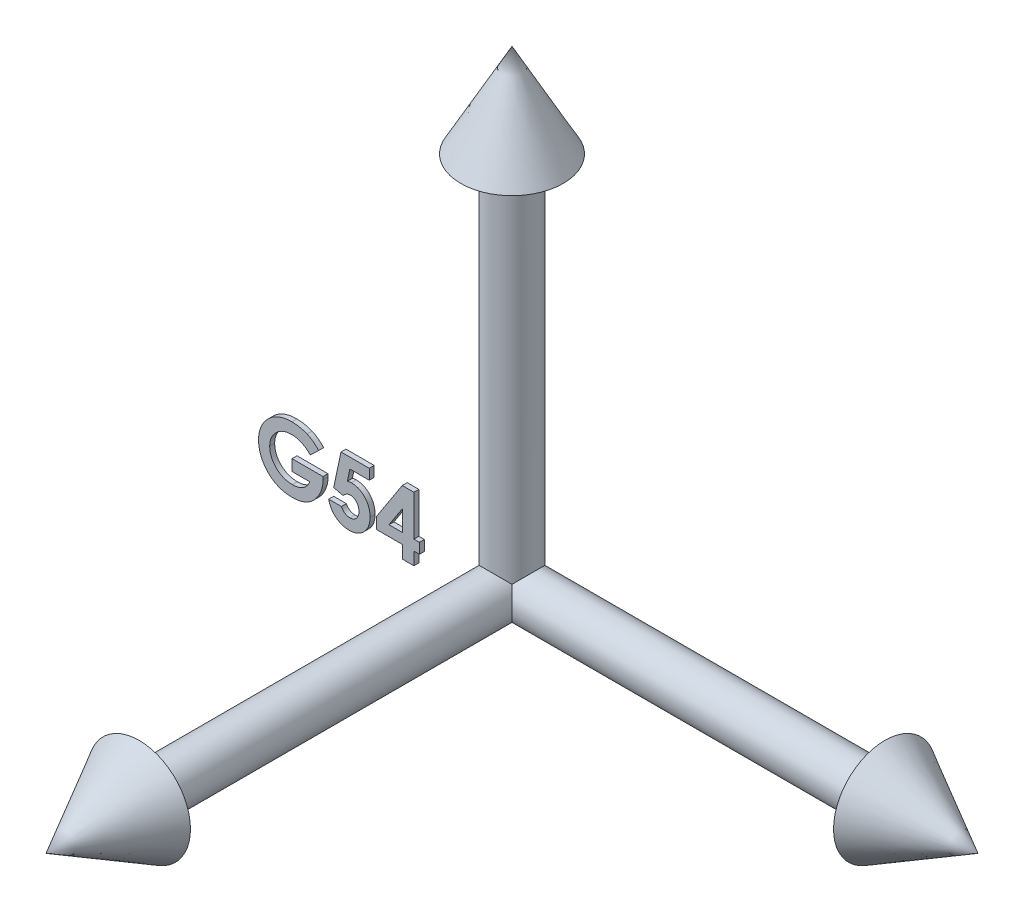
ISO-10303-21;
HEADER;
FILE_DESCRIPTION(('STEP AP214'),'2;1');
FILE_NAME('part.step','',(''),(''),'','','');
FILE_SCHEMA(('AUTOMOTIVE_DESIGN { 1 0 10303 214 1 1 1 1 }'));
ENDSEC;
DATA;
#1=APPLICATION_CONTEXT('core data for automotive mechanical design processes');
#2=APPLICATION_PROTOCOL_DEFINITION('international standard','automotive_design',2000,#1);
#3=PRODUCT_CONTEXT('',#1,'mechanical');
#4=PRODUCT('Part','Part','',(#3));
#5=PRODUCT_RELATED_PRODUCT_CATEGORY('part','',(#4));
#6=PRODUCT_DEFINITION_FORMATION('','',#4);
#7=PRODUCT_DEFINITION_CONTEXT('part definition',#1,'design');
#8=PRODUCT_DEFINITION('design','',#6,#7);
#9=PRODUCT_DEFINITION_SHAPE('','',#8);
#10=(LENGTH_UNIT() NAMED_UNIT(*) SI_UNIT(.MILLI.,.METRE.));
#11=(NAMED_UNIT(*) PLANE_ANGLE_UNIT() SI_UNIT($,.RADIAN.));
#12=(NAMED_UNIT(*) SI_UNIT($,.STERADIAN.) SOLID_ANGLE_UNIT());
#13=UNCERTAINTY_MEASURE_WITH_UNIT(LENGTH_MEASURE(1.E-05),#10,'distance_accuracy_value','');
#14=(GEOMETRIC_REPRESENTATION_CONTEXT(3) GLOBAL_UNCERTAINTY_ASSIGNED_CONTEXT((#13)) GLOBAL_UNIT_ASSIGNED_CONTEXT((#10,
#11,#12)) REPRESENTATION_CONTEXT('',''));
#15=CARTESIAN_POINT('',(0.,0.,0.));
#16=DIRECTION('',(0.,0.,1.));
#17=DIRECTION('',(1.,0.,0.));
#18=AXIS2_PLACEMENT_3D('',#15,#16,#17);
#19=CARTESIAN_POINT('',(0.,19.05,0.));
#20=DIRECTION('',(0.,-1.,0.));
#21=DIRECTION('',(0.,0.,-1.));
#22=AXIS2_PLACEMENT_3D('',#19,#20,#21);
#23=CYLINDRICAL_SURFACE('',#22,1.190625);
#24=CARTESIAN_POINT('',(0.,19.05,0.));
#25=DIRECTION('',(0.,1.,0.));
#26=DIRECTION('',(0.,0.,1.));
#27=AXIS2_PLACEMENT_3D('',#24,#25,#26);
#28=CIRCLE('',#27,1.190625);
#29=CARTESIAN_POINT('',(0.,19.05,1.190625));
#30=VERTEX_POINT('',#29);
#31=EDGE_CURVE('E115',#30,#30,#28,.T.);
#32=ORIENTED_EDGE('',*,*,#31,.F.);
#33=EDGE_LOOP('',(#32));
#34=FACE_BOUND('',#33,.T.);
#35=CARTESIAN_POINT('',(0.,0.,0.));
#36=DIRECTION('',(0.707106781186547,-0.707106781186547,0.));
#37=DIRECTION('',(-0.707106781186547,-0.707106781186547,0.));
#38=AXIS2_PLACEMENT_3D('',#35,#36,#37);
#39=ELLIPSE('',#38,1.68379802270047,1.190625);
#40=CARTESIAN_POINT('',(0.,0.,-1.190625));
#41=VERTEX_POINT('',#40);
#42=CARTESIAN_POINT('',(0.841899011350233,0.841899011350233,0.841899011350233));
#43=VERTEX_POINT('',#42);
#44=EDGE_CURVE('E116',#41,#43,#39,.T.);
#45=ORIENTED_EDGE('',*,*,#44,.F.);
#46=CARTESIAN_POINT('',(0.,0.,0.));
#47=DIRECTION('',(0.,1.,0.));
#48=DIRECTION('',(0.,0.,1.));
#49=AXIS2_PLACEMENT_3D('',#46,#47,#48);
#50=CIRCLE('',#49,1.190625);
#51=CARTESIAN_POINT('',(-1.190625,0.,0.));
#52=VERTEX_POINT('',#51);
#53=EDGE_CURVE('E117',#41,#52,#50,.T.);
#54=ORIENTED_EDGE('',*,*,#53,.T.);
#55=CARTESIAN_POINT('',(0.,0.,0.));
#56=DIRECTION('',(0.,-0.707106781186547,0.707106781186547));
#57=DIRECTION('',(0.,-0.707106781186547,-0.707106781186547));
#58=AXIS2_PLACEMENT_3D('',#55,#56,#57);
#59=ELLIPSE('',#58,1.68379802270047,1.190625);
#60=EDGE_CURVE('E69',#43,#52,#59,.T.);
#61=ORIENTED_EDGE('',*,*,#60,.F.);
#62=EDGE_LOOP('',(#45,#54,#61));
#63=FACE_BOUND('',#62,.T.);
#64=ADVANCED_FACE('F55',(#34,#63),#23,.T.);
#65=CARTESIAN_POINT('',(0.,0.,0.));
#66=DIRECTION('',(0.,1.,0.));
#67=DIRECTION('',(0.,0.,1.));
#68=AXIS2_PLACEMENT_3D('',#65,#66,#67);
#69=PLANE('',#68);
#70=DIRECTION('',(0.,0.,-1.));
#71=VECTOR('',#70,1.);
#72=CARTESIAN_POINT('',(0.,0.,0.));
#73=LINE('',#72,#71);
#74=CARTESIAN_POINT('',(0.,0.,0.));
#75=VERTEX_POINT('',#74);
#76=EDGE_CURVE('E13',#75,#41,#73,.T.);
#77=ORIENTED_EDGE('',*,*,#76,.F.);
#78=DIRECTION('',(1.,0.,0.));
#79=VECTOR('',#78,1.);
#80=CARTESIAN_POINT('',(0.,0.,0.));
#81=LINE('',#80,#79);
#82=EDGE_CURVE('E62',#52,#75,#81,.T.);
#83=ORIENTED_EDGE('',*,*,#82,.F.);
#84=ORIENTED_EDGE('',*,*,#53,.F.);
#85=EDGE_LOOP('',(#77,#83,#84));
#86=FACE_BOUND('',#85,.T.);
#87=ADVANCED_FACE('F107',(#86),#69,.F.);
#88=CARTESIAN_POINT('',(0.,19.05,0.));
#89=DIRECTION('',(0.,1.,0.));
#90=DIRECTION('',(0.,0.,1.));
#91=AXIS2_PLACEMENT_3D('',#88,#89,#90);
#92=PLANE('',#91);
#93=ORIENTED_EDGE('',*,*,#31,.T.);
#94=EDGE_LOOP('',(#93));
#95=FACE_BOUND('',#94,.T.);
#96=CARTESIAN_POINT('',(0.,19.05,0.));
#97=DIRECTION('',(0.,1.,0.));
#98=DIRECTION('',(0.,0.,1.));
#99=AXIS2_PLACEMENT_3D('',#96,#97,#98);
#100=CIRCLE('',#99,2.619375);
#101=CARTESIAN_POINT('',(0.,19.05,2.619375));
#102=VERTEX_POINT('',#101);
#103=EDGE_CURVE('E122',#102,#102,#100,.T.);
#104=ORIENTED_EDGE('',*,*,#103,.F.);
#105=EDGE_LOOP('',(#104));
#106=FACE_BOUND('',#105,.T.);
#107=ADVANCED_FACE('F112',(#95,#106),#92,.F.);
#108=CARTESIAN_POINT('',(0.,23.8125,0.));
#109=DIRECTION('',(0.,-1.,0.));
#110=DIRECTION('',(0.,0.,-1.));
#111=AXIS2_PLACEMENT_3D('',#108,#109,#110);
#112=CONICAL_SURFACE('',#111,0.,0.502843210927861);
#113=ORIENTED_EDGE('',*,*,#103,.T.);
#114=EDGE_LOOP('',(#113));
#115=FACE_BOUND('',#114,.T.);
#116=CARTESIAN_POINT('',(0.,23.8125,0.));
#117=VERTEX_POINT('',#116);
#118=VERTEX_LOOP('',#117);
#119=FACE_BOUND('',#118,.T.);
#120=ADVANCED_FACE('F178',(#115,#119),#112,.T.);
#121=CARTESIAN_POINT('',(19.05,0.,0.));
#122=DIRECTION('',(-1.,0.,0.));
#123=DIRECTION('',(0.,0.,1.));
#124=AXIS2_PLACEMENT_3D('',#121,#122,#123);
#125=CYLINDRICAL_SURFACE('',#124,1.190625);
#126=CARTESIAN_POINT('',(19.05,0.,0.));
#127=DIRECTION('',(1.,0.,0.));
#128=DIRECTION('',(0.,0.,-1.));
#129=AXIS2_PLACEMENT_3D('',#126,#127,#128);
#130=CIRCLE('',#129,1.190625);
#131=CARTESIAN_POINT('',(19.05,0.,-1.190625));
#132=VERTEX_POINT('',#131);
#133=EDGE_CURVE('E133',#132,#132,#130,.T.);
#134=ORIENTED_EDGE('',*,*,#133,.F.);
#135=EDGE_LOOP('',(#134));
#136=FACE_BOUND('',#135,.T.);
#137=CARTESIAN_POINT('',(0.,0.,0.));
#138=DIRECTION('',(1.,0.,0.));
#139=DIRECTION('',(0.,0.,-1.));
#140=AXIS2_PLACEMENT_3D('',#137,#138,#139);
#141=CIRCLE('',#140,1.190625);
#142=CARTESIAN_POINT('',(0.,-1.190625,0.));
#143=VERTEX_POINT('',#142);
#144=EDGE_CURVE('E129',#143,#41,#141,.T.);
#145=ORIENTED_EDGE('',*,*,#144,.T.);
#146=ORIENTED_EDGE('',*,*,#44,.T.);
#147=CARTESIAN_POINT('',(0.,0.,0.));
#148=DIRECTION('',(-0.707106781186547,0.,0.707106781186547));
#149=DIRECTION('',(-0.707106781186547,0.,-0.707106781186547));
#150=AXIS2_PLACEMENT_3D('',#147,#148,#149);
#151=ELLIPSE('',#150,1.68379802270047,1.190625);
#152=EDGE_CURVE('E132',#143,#43,#151,.T.);
#153=ORIENTED_EDGE('',*,*,#152,.F.);
#154=EDGE_LOOP('',(#145,#146,#153));
#155=FACE_BOUND('',#154,.T.);
#156=ADVANCED_FACE('F131',(#136,#155),#125,.T.);
#157=CARTESIAN_POINT('',(0.,0.,0.));
#158=DIRECTION('',(1.,0.,0.));
#159=DIRECTION('',(0.,0.,-1.));
#160=AXIS2_PLACEMENT_3D('',#157,#158,#159);
#161=PLANE('',#160);
#162=DIRECTION('',(0.,-1.,0.));
#163=VECTOR('',#162,1.);
#164=CARTESIAN_POINT('',(0.,0.,0.));
#165=LINE('',#164,#163);
#166=EDGE_CURVE('E130',#75,#143,#165,.T.);
#167=ORIENTED_EDGE('',*,*,#166,.F.);
#168=ORIENTED_EDGE('',*,*,#76,.T.);
#169=ORIENTED_EDGE('',*,*,#144,.F.);
#170=EDGE_LOOP('',(#167,#168,#169));
#171=FACE_BOUND('',#170,.T.);
#172=ADVANCED_FACE('F128',(#171),#161,.F.);
#173=CARTESIAN_POINT('',(0.,0.,19.05));
#174=DIRECTION('',(0.,0.,-1.));
#175=DIRECTION('',(-1.,0.,0.));
#176=AXIS2_PLACEMENT_3D('',#173,#174,#175);
#177=CYLINDRICAL_SURFACE('',#176,1.190625);
#178=CARTESIAN_POINT('',(0.,0.,19.05));
#179=DIRECTION('',(0.,0.,1.));
#180=DIRECTION('',(1.,0.,0.));
#181=AXIS2_PLACEMENT_3D('',#178,#179,#180);
#182=CIRCLE('',#181,1.190625);
#183=CARTESIAN_POINT('',(1.190625,0.,19.05));
#184=VERTEX_POINT('',#183);
#185=EDGE_CURVE('E151',#184,#184,#182,.T.);
#186=ORIENTED_EDGE('',*,*,#185,.F.);
#187=EDGE_LOOP('',(#186));
#188=FACE_BOUND('',#187,.T.);
#189=ORIENTED_EDGE('',*,*,#152,.T.);
#190=ORIENTED_EDGE('',*,*,#60,.T.);
#191=CARTESIAN_POINT('',(0.,0.,0.));
#192=DIRECTION('',(0.,0.,1.));
#193=DIRECTION('',(1.,0.,0.));
#194=AXIS2_PLACEMENT_3D('',#191,#192,#193);
#195=CIRCLE('',#194,1.190625);
#196=EDGE_CURVE('E149',#52,#143,#195,.T.);
#197=ORIENTED_EDGE('',*,*,#196,.T.);
#198=EDGE_LOOP('',(#189,#190,#197));
#199=FACE_BOUND('',#198,.T.);
#200=ADVANCED_FACE('F158',(#188,#199),#177,.T.);
#201=CARTESIAN_POINT('',(0.,0.,0.));
#202=DIRECTION('',(0.,0.,1.));
#203=DIRECTION('',(1.,0.,0.));
#204=AXIS2_PLACEMENT_3D('',#201,#202,#203);
#205=PLANE('',#204);
#206=ORIENTED_EDGE('',*,*,#196,.F.);
#207=ORIENTED_EDGE('',*,*,#82,.T.);
#208=ORIENTED_EDGE('',*,*,#166,.T.);
#209=EDGE_LOOP('',(#206,#207,#208));
#210=FACE_BOUND('',#209,.T.);
#211=ADVANCED_FACE('F147',(#210),#205,.F.);
#212=CARTESIAN_POINT('',(19.05,0.,0.));
#213=DIRECTION('',(1.,0.,0.));
#214=DIRECTION('',(0.,0.,-1.));
#215=AXIS2_PLACEMENT_3D('',#212,#213,#214);
#216=PLANE('',#215);
#217=ORIENTED_EDGE('',*,*,#133,.T.);
#218=EDGE_LOOP('',(#217));
#219=FACE_BOUND('',#218,.T.);
#220=CARTESIAN_POINT('',(19.05,0.,0.));
#221=DIRECTION('',(1.,0.,0.));
#222=DIRECTION('',(0.,0.,-1.));
#223=AXIS2_PLACEMENT_3D('',#220,#221,#222);
#224=CIRCLE('',#223,2.619375);
#225=CARTESIAN_POINT('',(19.05,0.,-2.619375));
#226=VERTEX_POINT('',#225);
#227=EDGE_CURVE('E134',#226,#226,#224,.T.);
#228=ORIENTED_EDGE('',*,*,#227,.F.);
#229=EDGE_LOOP('',(#228));
#230=FACE_BOUND('',#229,.T.);
#231=ADVANCED_FACE('F166',(#219,#230),#216,.F.);
#232=CARTESIAN_POINT('',(23.8125,0.,0.));
#233=DIRECTION('',(-1.,0.,0.));
#234=DIRECTION('',(0.,0.,1.));
#235=AXIS2_PLACEMENT_3D('',#232,#233,#234);
#236=CONICAL_SURFACE('',#235,0.,0.502843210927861);
#237=ORIENTED_EDGE('',*,*,#227,.T.);
#238=EDGE_LOOP('',(#237));
#239=FACE_BOUND('',#238,.T.);
#240=CARTESIAN_POINT('',(23.8125,0.,0.));
#241=VERTEX_POINT('',#240);
#242=VERTEX_LOOP('',#241);
#243=FACE_BOUND('',#242,.T.);
#244=ADVANCED_FACE('F101',(#239,#243),#236,.T.);
#245=CARTESIAN_POINT('',(0.,0.,19.05));
#246=DIRECTION('',(0.,0.,1.));
#247=DIRECTION('',(1.,0.,0.));
#248=AXIS2_PLACEMENT_3D('',#245,#246,#247);
#249=PLANE('',#248);
#250=ORIENTED_EDGE('',*,*,#185,.T.);
#251=EDGE_LOOP('',(#250));
#252=FACE_BOUND('',#251,.T.);
#253=CARTESIAN_POINT('',(0.,0.,19.05));
#254=DIRECTION('',(0.,0.,1.));
#255=DIRECTION('',(1.,0.,0.));
#256=AXIS2_PLACEMENT_3D('',#253,#254,#255);
#257=CIRCLE('',#256,2.619375);
#258=CARTESIAN_POINT('',(2.619375,0.,19.05));
#259=VERTEX_POINT('',#258);
#260=EDGE_CURVE('E152',#259,#259,#257,.T.);
#261=ORIENTED_EDGE('',*,*,#260,.F.);
#262=EDGE_LOOP('',(#261));
#263=FACE_BOUND('',#262,.T.);
#264=ADVANCED_FACE('F95',(#252,#263),#249,.F.);
#265=CARTESIAN_POINT('',(0.,0.,23.8125));
#266=DIRECTION('',(0.,0.,-1.));
#267=DIRECTION('',(-1.,0.,0.));
#268=AXIS2_PLACEMENT_3D('',#265,#266,#267);
#269=CONICAL_SURFACE('',#268,0.,0.502843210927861);
#270=ORIENTED_EDGE('',*,*,#260,.T.);
#271=EDGE_LOOP('',(#270));
#272=FACE_BOUND('',#271,.T.);
#273=CARTESIAN_POINT('',(0.,0.,23.8125));
#274=VERTEX_POINT('',#273);
#275=VERTEX_LOOP('',#274);
#276=FACE_BOUND('',#275,.T.);
#277=ADVANCED_FACE('F93',(#272,#276),#269,.T.);
#278=CLOSED_SHELL('',(#64,#87,#107,#120,#156,#172,#200,#211,#231,#244,#264,#277));
#279=MANIFOLD_SOLID_BREP('B2',#278);
#280=CARTESIAN_POINT('',(0.,0.,0.127));
#281=DIRECTION('',(0.,0.,-1.));
#282=DIRECTION('',(-1.,0.,0.));
#283=AXIS2_PLACEMENT_3D('',#280,#281,#282);
#284=PLANE('',#283);
#285=DIRECTION('',(0.545200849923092,0.838305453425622,0.));
#286=VECTOR('',#285,1.);
#287=CARTESIAN_POINT('',(-6.7996805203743,-0.331179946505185,0.127));
#288=LINE('',#287,#286);
#289=CARTESIAN_POINT('',(-6.7996805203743,-0.331179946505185,0.127));
#290=VERTEX_POINT('',#289);
#291=CARTESIAN_POINT('',(-5.48057995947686,1.69708026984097,0.127));
#292=VERTEX_POINT('',#291);
#293=EDGE_CURVE('E414',#290,#292,#288,.T.);
#294=ORIENTED_EDGE('',*,*,#293,.F.);
#295=DIRECTION('',(0.,1.,0.));
#296=VECTOR('',#295,1.);
#297=CARTESIAN_POINT('',(-6.7996805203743,-0.908047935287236,0.127));
#298=LINE('',#297,#296);
#299=CARTESIAN_POINT('',(-6.7996805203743,-0.908047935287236,0.127));
#300=VERTEX_POINT('',#299);
#301=EDGE_CURVE('E445',#300,#290,#298,.T.);
#302=ORIENTED_EDGE('',*,*,#301,.F.);
#303=DIRECTION('',(-1.,0.,0.));
#304=VECTOR('',#303,1.);
#305=CARTESIAN_POINT('',(-5.45641128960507,-0.908047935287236,0.127));
#306=LINE('',#305,#304);
#307=CARTESIAN_POINT('',(-5.45641128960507,-0.908047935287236,0.127));
#308=VERTEX_POINT('',#307);
#309=EDGE_CURVE('E442',#308,#300,#306,.T.);
#310=ORIENTED_EDGE('',*,*,#309,.F.);
#311=DIRECTION('',(0.,1.,0.));
#312=VECTOR('',#311,1.);
#313=CARTESIAN_POINT('',(-5.45641128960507,-1.55932998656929,0.127));
#314=LINE('',#313,#312);
#315=CARTESIAN_POINT('',(-5.45641128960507,-1.55932998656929,0.127));
#316=VERTEX_POINT('',#315);
#317=EDGE_CURVE('E439',#316,#308,#314,.T.);
#318=ORIENTED_EDGE('',*,*,#317,.F.);
#319=DIRECTION('',(-1.,0.,0.));
#320=VECTOR('',#319,1.);
#321=CARTESIAN_POINT('',(-4.88653949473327,-1.55932998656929,0.127));
#322=LINE('',#321,#320);
#323=CARTESIAN_POINT('',(-4.88653949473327,-1.55932998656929,0.127));
#324=VERTEX_POINT('',#323);
#325=EDGE_CURVE('E436',#324,#316,#322,.T.);
#326=ORIENTED_EDGE('',*,*,#325,.F.);
#327=DIRECTION('',(0.,-1.,0.));
#328=VECTOR('',#327,1.);
#329=CARTESIAN_POINT('',(-4.88653949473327,-0.908047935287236,0.127));
#330=LINE('',#329,#328);
#331=CARTESIAN_POINT('',(-4.88653949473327,-0.908047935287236,0.127));
#332=VERTEX_POINT('',#331);
#333=EDGE_CURVE('E433',#332,#324,#330,.T.);
#334=ORIENTED_EDGE('',*,*,#333,.F.);
#335=DIRECTION('',(-1.,0.,0.));
#336=VECTOR('',#335,1.);
#337=CARTESIAN_POINT('',(-4.60160359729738,-0.908047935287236,0.127));
#338=LINE('',#337,#336);
#339=CARTESIAN_POINT('',(-4.60160359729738,-0.908047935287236,0.127));
#340=VERTEX_POINT('',#339);
#341=EDGE_CURVE('E430',#340,#332,#338,.T.);
#342=ORIENTED_EDGE('',*,*,#341,.F.);
#343=DIRECTION('',(0.,-1.,0.));
#344=VECTOR('',#343,1.);
#345=CARTESIAN_POINT('',(-4.60160359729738,-0.378881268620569,0.127));
#346=LINE('',#345,#344);
#347=CARTESIAN_POINT('',(-4.60160359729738,-0.378881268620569,0.127));
#348=VERTEX_POINT('',#347);
#349=EDGE_CURVE('E427',#348,#340,#346,.T.);
#350=ORIENTED_EDGE('',*,*,#349,.F.);
#351=DIRECTION('',(1.,0.,0.));
#352=VECTOR('',#351,1.);
#353=CARTESIAN_POINT('',(-4.88653949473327,-0.378881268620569,0.127));
#354=LINE('',#353,#352);
#355=CARTESIAN_POINT('',(-4.88653949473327,-0.378881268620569,0.127));
#356=VERTEX_POINT('',#355);
#357=EDGE_CURVE('E424',#356,#348,#354,.T.);
#358=ORIENTED_EDGE('',*,*,#357,.F.);
#359=DIRECTION('',(0.,-1.,0.));
#360=VECTOR('',#359,1.);
#361=CARTESIAN_POINT('',(-4.88653949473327,1.69708026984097,0.127));
#362=LINE('',#361,#360);
#363=CARTESIAN_POINT('',(-4.88653949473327,1.69708026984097,0.127));
#364=VERTEX_POINT('',#363);
#365=EDGE_CURVE('E421',#364,#356,#362,.T.);
#366=ORIENTED_EDGE('',*,*,#365,.F.);
#367=DIRECTION('',(1.,0.,0.));
#368=VECTOR('',#367,1.);
#369=CARTESIAN_POINT('',(-5.48057995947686,1.69708026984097,0.127));
#370=LINE('',#369,#368);
#371=EDGE_CURVE('E417',#292,#364,#370,.T.);
#372=ORIENTED_EDGE('',*,*,#371,.F.);
#373=EDGE_LOOP('',(#294,#302,#310,#318,#326,#334,#342,#350,#358,#366,#372));
#374=FACE_BOUND('',#373,.T.);
#375=DIRECTION('',(1.,0.,0.));
#376=VECTOR('',#375,1.);
#377=CARTESIAN_POINT('',(-6.15921076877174,-0.378881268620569,0.127));
#378=LINE('',#377,#376);
#379=CARTESIAN_POINT('',(-6.15921076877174,-0.378881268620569,0.127));
#380=VERTEX_POINT('',#379);
#381=CARTESIAN_POINT('',(-5.45641128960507,-0.378881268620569,0.127));
#382=VERTEX_POINT('',#381);
#383=EDGE_CURVE('E387',#380,#382,#378,.T.);
#384=ORIENTED_EDGE('',*,*,#383,.F.);
#385=DIRECTION('',(-0.545213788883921,-0.838297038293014,0.));
#386=VECTOR('',#385,1.);
#387=CARTESIAN_POINT('',(-5.45641128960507,0.701712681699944,0.127));
#388=LINE('',#387,#386);
#389=CARTESIAN_POINT('',(-5.45641128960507,0.701712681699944,0.127));
#390=VERTEX_POINT('',#389);
#391=EDGE_CURVE('E404',#390,#380,#388,.T.);
#392=ORIENTED_EDGE('',*,*,#391,.F.);
#393=DIRECTION('',(0.,1.,0.));
#394=VECTOR('',#393,1.);
#395=CARTESIAN_POINT('',(-5.45641128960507,-0.378881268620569,0.127));
#396=LINE('',#395,#394);
#397=EDGE_CURVE('E395',#382,#390,#396,.T.);
#398=ORIENTED_EDGE('',*,*,#397,.F.);
#399=EDGE_LOOP('',(#384,#392,#398));
#400=FACE_BOUND('',#399,.T.);
#401=ADVANCED_FACE('F285',(#374,#400),#284,.F.);
#402=CARTESIAN_POINT('',(0.,0.,-0.127));
#403=DIRECTION('',(0.,0.,-1.));
#404=DIRECTION('',(-1.,0.,0.));
#405=AXIS2_PLACEMENT_3D('',#402,#403,#404);
#406=PLANE('',#405);
#407=DIRECTION('',(0.545200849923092,0.838305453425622,0.));
#408=VECTOR('',#407,1.);
#409=CARTESIAN_POINT('',(-6.7996805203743,-0.331179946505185,-0.127));
#410=LINE('',#409,#408);
#411=CARTESIAN_POINT('',(-6.7996805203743,-0.331179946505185,-0.127));
#412=VERTEX_POINT('',#411);
#413=CARTESIAN_POINT('',(-5.48057995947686,1.69708026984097,-0.127));
#414=VERTEX_POINT('',#413);
#415=EDGE_CURVE('E402',#412,#414,#410,.T.);
#416=ORIENTED_EDGE('',*,*,#415,.T.);
#417=DIRECTION('',(1.,0.,0.));
#418=VECTOR('',#417,1.);
#419=CARTESIAN_POINT('',(-5.48057995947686,1.69708026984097,-0.127));
#420=LINE('',#419,#418);
#421=CARTESIAN_POINT('',(-4.88653949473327,1.69708026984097,-0.127));
#422=VERTEX_POINT('',#421);
#423=EDGE_CURVE('E450',#414,#422,#420,.T.);
#424=ORIENTED_EDGE('',*,*,#423,.T.);
#425=DIRECTION('',(0.,-1.,0.));
#426=VECTOR('',#425,1.);
#427=CARTESIAN_POINT('',(-4.88653949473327,1.69708026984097,-0.127));
#428=LINE('',#427,#426);
#429=CARTESIAN_POINT('',(-4.88653949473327,-0.378881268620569,-0.127));
#430=VERTEX_POINT('',#429);
#431=EDGE_CURVE('E453',#422,#430,#428,.T.);
#432=ORIENTED_EDGE('',*,*,#431,.T.);
#433=DIRECTION('',(1.,0.,0.));
#434=VECTOR('',#433,1.);
#435=CARTESIAN_POINT('',(-4.88653949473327,-0.378881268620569,-0.127));
#436=LINE('',#435,#434);
#437=CARTESIAN_POINT('',(-4.60160359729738,-0.378881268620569,-0.127));
#438=VERTEX_POINT('',#437);
#439=EDGE_CURVE('E456',#430,#438,#436,.T.);
#440=ORIENTED_EDGE('',*,*,#439,.T.);
#441=DIRECTION('',(0.,-1.,0.));
#442=VECTOR('',#441,1.);
#443=CARTESIAN_POINT('',(-4.60160359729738,-0.378881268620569,-0.127));
#444=LINE('',#443,#442);
#445=CARTESIAN_POINT('',(-4.60160359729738,-0.908047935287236,-0.127));
#446=VERTEX_POINT('',#445);
#447=EDGE_CURVE('E459',#438,#446,#444,.T.);
#448=ORIENTED_EDGE('',*,*,#447,.T.);
#449=DIRECTION('',(-1.,0.,0.));
#450=VECTOR('',#449,1.);
#451=CARTESIAN_POINT('',(-4.60160359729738,-0.908047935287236,-0.127));
#452=LINE('',#451,#450);
#453=CARTESIAN_POINT('',(-4.88653949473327,-0.908047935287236,-0.127));
#454=VERTEX_POINT('',#453);
#455=EDGE_CURVE('E462',#446,#454,#452,.T.);
#456=ORIENTED_EDGE('',*,*,#455,.T.);
#457=DIRECTION('',(0.,-1.,0.));
#458=VECTOR('',#457,1.);
#459=CARTESIAN_POINT('',(-4.88653949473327,-0.908047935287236,-0.127));
#460=LINE('',#459,#458);
#461=CARTESIAN_POINT('',(-4.88653949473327,-1.55932998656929,-0.127));
#462=VERTEX_POINT('',#461);
#463=EDGE_CURVE('E465',#454,#462,#460,.T.);
#464=ORIENTED_EDGE('',*,*,#463,.T.);
#465=DIRECTION('',(-1.,0.,0.));
#466=VECTOR('',#465,1.);
#467=CARTESIAN_POINT('',(-4.88653949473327,-1.55932998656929,-0.127));
#468=LINE('',#467,#466);
#469=CARTESIAN_POINT('',(-5.45641128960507,-1.55932998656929,-0.127));
#470=VERTEX_POINT('',#469);
#471=EDGE_CURVE('E468',#462,#470,#468,.T.);
#472=ORIENTED_EDGE('',*,*,#471,.T.);
#473=DIRECTION('',(0.,1.,0.));
#474=VECTOR('',#473,1.);
#475=CARTESIAN_POINT('',(-5.45641128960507,-1.55932998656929,-0.127));
#476=LINE('',#475,#474);
#477=CARTESIAN_POINT('',(-5.45641128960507,-0.908047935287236,-0.127));
#478=VERTEX_POINT('',#477);
#479=EDGE_CURVE('E471',#470,#478,#476,.T.);
#480=ORIENTED_EDGE('',*,*,#479,.T.);
#481=DIRECTION('',(-1.,0.,0.));
#482=VECTOR('',#481,1.);
#483=CARTESIAN_POINT('',(-5.45641128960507,-0.908047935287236,-0.127));
#484=LINE('',#483,#482);
#485=CARTESIAN_POINT('',(-6.7996805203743,-0.908047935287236,-0.127));
#486=VERTEX_POINT('',#485);
#487=EDGE_CURVE('E474',#478,#486,#484,.T.);
#488=ORIENTED_EDGE('',*,*,#487,.T.);
#489=DIRECTION('',(0.,1.,0.));
#490=VECTOR('',#489,1.);
#491=CARTESIAN_POINT('',(-6.7996805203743,-0.908047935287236,-0.127));
#492=LINE('',#491,#490);
#493=EDGE_CURVE('E418',#486,#412,#492,.T.);
#494=ORIENTED_EDGE('',*,*,#493,.T.);
#495=EDGE_LOOP('',(#416,#424,#432,#440,#448,#456,#464,#472,#480,#488,#494));
#496=FACE_BOUND('',#495,.T.);
#497=DIRECTION('',(-0.545213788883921,-0.838297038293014,0.));
#498=VECTOR('',#497,1.);
#499=CARTESIAN_POINT('',(-5.45641128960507,0.701712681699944,-0.127));
#500=LINE('',#499,#498);
#501=CARTESIAN_POINT('',(-5.45641128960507,0.701712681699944,-0.127));
#502=VERTEX_POINT('',#501);
#503=CARTESIAN_POINT('',(-6.15921076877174,-0.37888126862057,-0.127));
#504=VERTEX_POINT('',#503);
#505=EDGE_CURVE('E396',#502,#504,#500,.T.);
#506=ORIENTED_EDGE('',*,*,#505,.T.);
#507=DIRECTION('',(1.,0.,0.));
#508=VECTOR('',#507,1.);
#509=CARTESIAN_POINT('',(-6.15921076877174,-0.378881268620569,-0.127));
#510=LINE('',#509,#508);
#511=CARTESIAN_POINT('',(-5.45641128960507,-0.378881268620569,-0.127));
#512=VERTEX_POINT('',#511);
#513=EDGE_CURVE('E310',#504,#512,#510,.T.);
#514=ORIENTED_EDGE('',*,*,#513,.T.);
#515=DIRECTION('',(0.,1.,0.));
#516=VECTOR('',#515,1.);
#517=CARTESIAN_POINT('',(-5.45641128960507,-0.378881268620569,-0.127));
#518=LINE('',#517,#516);
#519=EDGE_CURVE('E401',#512,#502,#518,.T.);
#520=ORIENTED_EDGE('',*,*,#519,.T.);
#521=EDGE_LOOP('',(#506,#514,#520));
#522=FACE_BOUND('',#521,.T.);
#523=ADVANCED_FACE('F503',(#496,#522),#406,.T.);
#524=CARTESIAN_POINT('',(-6.7996805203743,-0.331179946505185,0.127));
#525=DIRECTION('',(-0.838305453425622,0.545200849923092,0.));
#526=DIRECTION('',(-0.545200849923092,-0.838305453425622,0.));
#527=AXIS2_PLACEMENT_3D('',#524,#525,#526);
#528=PLANE('',#527);
#529=ORIENTED_EDGE('',*,*,#415,.F.);
#530=DIRECTION('',(0.,0.,-1.));
#531=VECTOR('',#530,1.);
#532=CARTESIAN_POINT('',(-6.7996805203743,-0.331179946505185,0.127));
#533=LINE('',#532,#531);
#534=EDGE_CURVE('E53',#290,#412,#533,.T.);
#535=ORIENTED_EDGE('',*,*,#534,.F.);
#536=ORIENTED_EDGE('',*,*,#293,.T.);
#537=DIRECTION('',(0.,0.,-1.));
#538=VECTOR('',#537,1.);
#539=CARTESIAN_POINT('',(-5.48057995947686,1.69708026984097,0.127));
#540=LINE('',#539,#538);
#541=EDGE_CURVE('E289',#292,#414,#540,.T.);
#542=ORIENTED_EDGE('',*,*,#541,.T.);
#543=EDGE_LOOP('',(#529,#535,#536,#542));
#544=FACE_BOUND('',#543,.T.);
#545=ADVANCED_FACE('F287',(#544),#528,.T.);
#546=CARTESIAN_POINT('',(-6.7996805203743,-0.908047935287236,0.127));
#547=DIRECTION('',(-1.,0.,0.));
#548=DIRECTION('',(0.,0.,1.));
#549=AXIS2_PLACEMENT_3D('',#546,#547,#548);
#550=PLANE('',#549);
#551=ORIENTED_EDGE('',*,*,#493,.F.);
#552=DIRECTION('',(0.,0.,-1.));
#553=VECTOR('',#552,1.);
#554=CARTESIAN_POINT('',(-6.7996805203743,-0.908047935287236,0.127));
#555=LINE('',#554,#553);
#556=EDGE_CURVE('E294',#300,#486,#555,.T.);
#557=ORIENTED_EDGE('',*,*,#556,.F.);
#558=ORIENTED_EDGE('',*,*,#301,.T.);
#559=ORIENTED_EDGE('',*,*,#534,.T.);
#560=EDGE_LOOP('',(#551,#557,#558,#559));
#561=FACE_BOUND('',#560,.T.);
#562=ADVANCED_FACE('F508',(#561),#550,.T.);
#563=CARTESIAN_POINT('',(-5.45641128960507,-0.908047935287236,0.127));
#564=DIRECTION('',(0.,-1.,0.));
#565=DIRECTION('',(0.,0.,-1.));
#566=AXIS2_PLACEMENT_3D('',#563,#564,#565);
#567=PLANE('',#566);
#568=ORIENTED_EDGE('',*,*,#487,.F.);
#569=DIRECTION('',(0.,0.,-1.));
#570=VECTOR('',#569,1.);
#571=CARTESIAN_POINT('',(-5.45641128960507,-0.908047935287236,0.127));
#572=LINE('',#571,#570);
#573=EDGE_CURVE('E480',#308,#478,#572,.T.);
#574=ORIENTED_EDGE('',*,*,#573,.F.);
#575=ORIENTED_EDGE('',*,*,#309,.T.);
#576=ORIENTED_EDGE('',*,*,#556,.T.);
#577=EDGE_LOOP('',(#568,#574,#575,#576));
#578=FACE_BOUND('',#577,.T.);
#579=ADVANCED_FACE('F540',(#578),#567,.T.);
#580=CARTESIAN_POINT('',(-5.45641128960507,-1.55932998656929,0.127));
#581=DIRECTION('',(-1.,0.,0.));
#582=DIRECTION('',(0.,0.,1.));
#583=AXIS2_PLACEMENT_3D('',#580,#581,#582);
#584=PLANE('',#583);
#585=ORIENTED_EDGE('',*,*,#479,.F.);
#586=DIRECTION('',(0.,0.,-1.));
#587=VECTOR('',#586,1.);
#588=CARTESIAN_POINT('',(-5.45641128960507,-1.55932998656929,0.127));
#589=LINE('',#588,#587);
#590=EDGE_CURVE('E482',#316,#470,#589,.T.);
#591=ORIENTED_EDGE('',*,*,#590,.F.);
#592=ORIENTED_EDGE('',*,*,#317,.T.);
#593=ORIENTED_EDGE('',*,*,#573,.T.);
#594=EDGE_LOOP('',(#585,#591,#592,#593));
#595=FACE_BOUND('',#594,.T.);
#596=ADVANCED_FACE('F538',(#595),#584,.T.);
#597=CARTESIAN_POINT('',(-4.88653949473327,-1.55932998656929,0.127));
#598=DIRECTION('',(0.,-1.,0.));
#599=DIRECTION('',(0.,0.,-1.));
#600=AXIS2_PLACEMENT_3D('',#597,#598,#599);
#601=PLANE('',#600);
#602=ORIENTED_EDGE('',*,*,#471,.F.);
#603=DIRECTION('',(0.,0.,-1.));
#604=VECTOR('',#603,1.);
#605=CARTESIAN_POINT('',(-4.88653949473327,-1.55932998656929,0.127));
#606=LINE('',#605,#604);
#607=EDGE_CURVE('E484',#324,#462,#606,.T.);
#608=ORIENTED_EDGE('',*,*,#607,.F.);
#609=ORIENTED_EDGE('',*,*,#325,.T.);
#610=ORIENTED_EDGE('',*,*,#590,.T.);
#611=EDGE_LOOP('',(#602,#608,#609,#610));
#612=FACE_BOUND('',#611,.T.);
#613=ADVANCED_FACE('F534',(#612),#601,.T.);
#614=CARTESIAN_POINT('',(-4.88653949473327,-0.908047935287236,0.127));
#615=DIRECTION('',(1.,0.,0.));
#616=DIRECTION('',(0.,0.,-1.));
#617=AXIS2_PLACEMENT_3D('',#614,#615,#616);
#618=PLANE('',#617);
#619=ORIENTED_EDGE('',*,*,#463,.F.);
#620=DIRECTION('',(0.,0.,-1.));
#621=VECTOR('',#620,1.);
#622=CARTESIAN_POINT('',(-4.88653949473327,-0.908047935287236,0.127));
#623=LINE('',#622,#621);
#624=EDGE_CURVE('E486',#332,#454,#623,.T.);
#625=ORIENTED_EDGE('',*,*,#624,.F.);
#626=ORIENTED_EDGE('',*,*,#333,.T.);
#627=ORIENTED_EDGE('',*,*,#607,.T.);
#628=EDGE_LOOP('',(#619,#625,#626,#627));
#629=FACE_BOUND('',#628,.T.);
#630=ADVANCED_FACE('F530',(#629),#618,.T.);
#631=CARTESIAN_POINT('',(-4.60160359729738,-0.908047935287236,0.127));
#632=DIRECTION('',(0.,-1.,0.));
#633=DIRECTION('',(0.,0.,-1.));
#634=AXIS2_PLACEMENT_3D('',#631,#632,#633);
#635=PLANE('',#634);
#636=ORIENTED_EDGE('',*,*,#455,.F.);
#637=DIRECTION('',(0.,0.,-1.));
#638=VECTOR('',#637,1.);
#639=CARTESIAN_POINT('',(-4.60160359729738,-0.908047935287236,0.127));
#640=LINE('',#639,#638);
#641=EDGE_CURVE('E488',#340,#446,#640,.T.);
#642=ORIENTED_EDGE('',*,*,#641,.F.);
#643=ORIENTED_EDGE('',*,*,#341,.T.);
#644=ORIENTED_EDGE('',*,*,#624,.T.);
#645=EDGE_LOOP('',(#636,#642,#643,#644));
#646=FACE_BOUND('',#645,.T.);
#647=ADVANCED_FACE('F526',(#646),#635,.T.);
#648=CARTESIAN_POINT('',(-4.60160359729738,-0.378881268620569,0.127));
#649=DIRECTION('',(1.,0.,0.));
#650=DIRECTION('',(0.,0.,-1.));
#651=AXIS2_PLACEMENT_3D('',#648,#649,#650);
#652=PLANE('',#651);
#653=ORIENTED_EDGE('',*,*,#447,.F.);
#654=DIRECTION('',(0.,0.,-1.));
#655=VECTOR('',#654,1.);
#656=CARTESIAN_POINT('',(-4.60160359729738,-0.378881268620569,0.127));
#657=LINE('',#656,#655);
#658=EDGE_CURVE('E490',#348,#438,#657,.T.);
#659=ORIENTED_EDGE('',*,*,#658,.F.);
#660=ORIENTED_EDGE('',*,*,#349,.T.);
#661=ORIENTED_EDGE('',*,*,#641,.T.);
#662=EDGE_LOOP('',(#653,#659,#660,#661));
#663=FACE_BOUND('',#662,.T.);
#664=ADVANCED_FACE('F522',(#663),#652,.T.);
#665=CARTESIAN_POINT('',(-4.88653949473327,-0.378881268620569,0.127));
#666=DIRECTION('',(0.,1.,0.));
#667=DIRECTION('',(0.,0.,1.));
#668=AXIS2_PLACEMENT_3D('',#665,#666,#667);
#669=PLANE('',#668);
#670=ORIENTED_EDGE('',*,*,#439,.F.);
#671=DIRECTION('',(0.,0.,-1.));
#672=VECTOR('',#671,1.);
#673=CARTESIAN_POINT('',(-4.88653949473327,-0.378881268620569,0.127));
#674=LINE('',#673,#672);
#675=EDGE_CURVE('E492',#356,#430,#674,.T.);
#676=ORIENTED_EDGE('',*,*,#675,.F.);
#677=ORIENTED_EDGE('',*,*,#357,.T.);
#678=ORIENTED_EDGE('',*,*,#658,.T.);
#679=EDGE_LOOP('',(#670,#676,#677,#678));
#680=FACE_BOUND('',#679,.T.);
#681=ADVANCED_FACE('F520',(#680),#669,.T.);
#682=CARTESIAN_POINT('',(-4.88653949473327,1.69708026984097,0.127));
#683=DIRECTION('',(1.,0.,0.));
#684=DIRECTION('',(0.,0.,-1.));
#685=AXIS2_PLACEMENT_3D('',#682,#683,#684);
#686=PLANE('',#685);
#687=ORIENTED_EDGE('',*,*,#431,.F.);
#688=DIRECTION('',(0.,0.,-1.));
#689=VECTOR('',#688,1.);
#690=CARTESIAN_POINT('',(-4.88653949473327,1.69708026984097,0.127));
#691=LINE('',#690,#689);
#692=EDGE_CURVE('E493',#364,#422,#691,.T.);
#693=ORIENTED_EDGE('',*,*,#692,.F.);
#694=ORIENTED_EDGE('',*,*,#365,.T.);
#695=ORIENTED_EDGE('',*,*,#675,.T.);
#696=EDGE_LOOP('',(#687,#693,#694,#695));
#697=FACE_BOUND('',#696,.T.);
#698=ADVANCED_FACE('F516',(#697),#686,.T.);
#699=CARTESIAN_POINT('',(-5.48057995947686,1.69708026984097,0.127));
#700=DIRECTION('',(0.,1.,0.));
#701=DIRECTION('',(0.,0.,1.));
#702=AXIS2_PLACEMENT_3D('',#699,#700,#701);
#703=PLANE('',#702);
#704=ORIENTED_EDGE('',*,*,#423,.F.);
#705=ORIENTED_EDGE('',*,*,#541,.F.);
#706=ORIENTED_EDGE('',*,*,#371,.T.);
#707=ORIENTED_EDGE('',*,*,#692,.T.);
#708=EDGE_LOOP('',(#704,#705,#706,#707));
#709=FACE_BOUND('',#708,.T.);
#710=ADVANCED_FACE('F501',(#709),#703,.T.);
#711=CARTESIAN_POINT('',(-6.15921076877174,-0.378881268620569,0.127));
#712=DIRECTION('',(0.,1.,0.));
#713=DIRECTION('',(0.,0.,1.));
#714=AXIS2_PLACEMENT_3D('',#711,#712,#713);
#715=PLANE('',#714);
#716=ORIENTED_EDGE('',*,*,#513,.F.);
#717=DIRECTION('',(0.,0.,-1.));
#718=VECTOR('',#717,1.);
#719=CARTESIAN_POINT('',(-6.15921076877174,-0.378881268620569,0.127));
#720=LINE('',#719,#718);
#721=EDGE_CURVE('E391',#380,#504,#720,.T.);
#722=ORIENTED_EDGE('',*,*,#721,.F.);
#723=ORIENTED_EDGE('',*,*,#383,.T.);
#724=DIRECTION('',(0.,0.,-1.));
#725=VECTOR('',#724,1.);
#726=CARTESIAN_POINT('',(-5.45641128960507,-0.378881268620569,0.127));
#727=LINE('',#726,#725);
#728=EDGE_CURVE('E390',#382,#512,#727,.T.);
#729=ORIENTED_EDGE('',*,*,#728,.T.);
#730=EDGE_LOOP('',(#716,#722,#723,#729));
#731=FACE_BOUND('',#730,.T.);
#732=ADVANCED_FACE('F389',(#731),#715,.T.);
#733=CARTESIAN_POINT('',(-5.45641128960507,-0.378881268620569,0.127));
#734=DIRECTION('',(-1.,0.,0.));
#735=DIRECTION('',(0.,0.,1.));
#736=AXIS2_PLACEMENT_3D('',#733,#734,#735);
#737=PLANE('',#736);
#738=ORIENTED_EDGE('',*,*,#519,.F.);
#739=ORIENTED_EDGE('',*,*,#728,.F.);
#740=ORIENTED_EDGE('',*,*,#397,.T.);
#741=DIRECTION('',(0.,0.,-1.));
#742=VECTOR('',#741,1.);
#743=CARTESIAN_POINT('',(-5.45641128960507,0.701712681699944,0.127));
#744=LINE('',#743,#742);
#745=EDGE_CURVE('E302',#390,#502,#744,.T.);
#746=ORIENTED_EDGE('',*,*,#745,.T.);
#747=EDGE_LOOP('',(#738,#739,#740,#746));
#748=FACE_BOUND('',#747,.T.);
#749=ADVANCED_FACE('F399',(#748),#737,.T.);
#750=CARTESIAN_POINT('',(-5.45641128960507,0.701712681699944,0.127));
#751=DIRECTION('',(0.838297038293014,-0.545213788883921,0.));
#752=DIRECTION('',(0.545213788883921,0.838297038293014,0.));
#753=AXIS2_PLACEMENT_3D('',#750,#751,#752);
#754=PLANE('',#753);
#755=ORIENTED_EDGE('',*,*,#505,.F.);
#756=ORIENTED_EDGE('',*,*,#745,.F.);
#757=ORIENTED_EDGE('',*,*,#391,.T.);
#758=ORIENTED_EDGE('',*,*,#721,.T.);
#759=EDGE_LOOP('',(#755,#756,#757,#758));
#760=FACE_BOUND('',#759,.T.);
#761=ADVANCED_FACE('F560',(#760),#754,.T.);
#762=CLOSED_SHELL('',(#401,#523,#545,#562,#579,#596,#613,#630,#647,#664,#681,#698,#710,#732,
#749,#761));
#763=MANIFOLD_SOLID_BREP('B7',#762);
#764=CARTESIAN_POINT('',(-8.98503709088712,-0.146098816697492,0.127));
#765=DIRECTION('',(-0.978275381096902,0.207309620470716,0.));
#766=DIRECTION('',(-0.207309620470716,-0.978275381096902,0.));
#767=AXIS2_PLACEMENT_3D('',#764,#765,#766);
#768=PLANE('',#767);
#769=DIRECTION('',(0.207309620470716,0.978275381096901,0.));
#770=VECTOR('',#769,1.);
#771=CARTESIAN_POINT('',(-8.98503709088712,-0.146098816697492,-0.127));
#772=LINE('',#771,#770);
#773=CARTESIAN_POINT('',(-8.98503709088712,-0.146098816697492,-0.127));
#774=VERTEX_POINT('',#773);
#775=CARTESIAN_POINT('',(-8.61169474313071,1.61567001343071,-0.127));
#776=VERTEX_POINT('',#775);
#777=EDGE_CURVE('E977',#774,#776,#772,.T.);
#778=ORIENTED_EDGE('',*,*,#777,.F.);
#779=DIRECTION('',(0.,0.,-1.));
#780=VECTOR('',#779,1.);
#781=CARTESIAN_POINT('',(-8.98503709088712,-0.146098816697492,0.127));
#782=LINE('',#781,#780);
#783=CARTESIAN_POINT('',(-8.98503709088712,-0.146098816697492,0.127));
#784=VERTEX_POINT('',#783);
#785=EDGE_CURVE('E283',#784,#774,#782,.T.);
#786=ORIENTED_EDGE('',*,*,#785,.F.);
#787=DIRECTION('',(0.207309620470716,0.978275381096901,0.));
#788=VECTOR('',#787,1.);
#789=CARTESIAN_POINT('',(-8.98503709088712,-0.146098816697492,0.127));
#790=LINE('',#789,#788);
#791=CARTESIAN_POINT('',(-8.61169474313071,1.61567001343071,0.127));
#792=VERTEX_POINT('',#791);
#793=EDGE_CURVE('E943',#784,#792,#790,.T.);
#794=ORIENTED_EDGE('',*,*,#793,.T.);
#795=DIRECTION('',(0.,0.,-1.));
#796=VECTOR('',#795,1.);
#797=CARTESIAN_POINT('',(-8.61169474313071,1.61567001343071,0.127));
#798=LINE('',#797,#796);
#799=EDGE_CURVE('E713',#792,#776,#798,.T.);
#800=ORIENTED_EDGE('',*,*,#799,.T.);
#801=EDGE_LOOP('',(#778,#786,#794,#800));
#802=FACE_BOUND('',#801,.T.);
#803=ADVANCED_FACE('F710',(#802),#768,.T.);
#804=CARTESIAN_POINT('',(-8.50547979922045,-0.256129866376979,0.127));
#805=DIRECTION('',(-0.223632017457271,-0.974673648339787,0.));
#806=DIRECTION('',(0.974673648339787,-0.223632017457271,0.));
#807=AXIS2_PLACEMENT_3D('',#804,#805,#806);
#808=PLANE('',#807);
#809=DIRECTION('',(-0.974673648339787,0.223632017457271,0.));
#810=VECTOR('',#809,1.);
#811=CARTESIAN_POINT('',(-8.50547979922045,-0.256129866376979,-0.127));
#812=LINE('',#811,#810);
#813=CARTESIAN_POINT('',(-8.50547979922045,-0.256129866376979,-0.127));
#814=VERTEX_POINT('',#813);
#815=EDGE_CURVE('E944',#814,#774,#812,.T.);
#816=ORIENTED_EDGE('',*,*,#815,.F.);
#817=DIRECTION('',(0.,0.,-1.));
#818=VECTOR('',#817,1.);
#819=CARTESIAN_POINT('',(-8.50547979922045,-0.256129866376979,0.127));
#820=LINE('',#819,#818);
#821=CARTESIAN_POINT('',(-8.50547979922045,-0.256129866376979,0.127));
#822=VERTEX_POINT('',#821);
#823=EDGE_CURVE('E719',#822,#814,#820,.T.);
#824=ORIENTED_EDGE('',*,*,#823,.F.);
#825=DIRECTION('',(-0.974673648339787,0.223632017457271,0.));
#826=VECTOR('',#825,1.);
#827=CARTESIAN_POINT('',(-8.50547979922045,-0.256129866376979,0.127));
#828=LINE('',#827,#826);
#829=EDGE_CURVE('E839',#822,#784,#828,.T.);
#830=ORIENTED_EDGE('',*,*,#829,.T.);
#831=ORIENTED_EDGE('',*,*,#785,.T.);
#832=EDGE_LOOP('',(#816,#824,#830,#831));
#833=FACE_BOUND('',#832,.T.);
#834=ADVANCED_FACE('F1083',(#833),#808,.T.);
#835=CARTESIAN_POINT('',(-8.13086541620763,-0.0532402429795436,0.127));
#836=CARTESIAN_POINT('',(-8.14702397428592,-0.0538533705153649,0.127));
#837=CARTESIAN_POINT('',(-8.17940919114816,-0.0550822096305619,0.127));
#838=CARTESIAN_POINT('',(-8.22752551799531,-0.065080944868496,0.127));
#839=CARTESIAN_POINT('',(-8.27506169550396,-0.0812626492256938,0.127));
#840=CARTESIAN_POINT('',(-8.32228207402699,-0.103587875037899,0.127));
#841=CARTESIAN_POINT('',(-8.36871790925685,-0.132804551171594,0.127));
#842=CARTESIAN_POINT('',(-8.41559466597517,-0.16707236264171,0.127));
#843=CARTESIAN_POINT('',(-8.4613432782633,-0.20888119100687,0.127));
#844=CARTESIAN_POINT('',(-8.4904315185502,-0.240020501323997,0.127));
#845=CARTESIAN_POINT('',(-8.50547979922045,-0.256129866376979,0.127));
#846=B_SPLINE_CURVE_WITH_KNOTS('',3,(#835,#836,#837,#838,#839,#840,#841,#842,#843,#844,#845),
.UNSPECIFIED.,.F.,.F.,(4,1,1,1,1,1,1,1,4),(0.,0.11036033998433,0.221185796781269,
0.334363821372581,0.452976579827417,0.57723430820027,0.708804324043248,0.849355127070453,1.),.UNSPECIFIED.);
#847=DIRECTION('',(0.,0.,-1.));
#848=VECTOR('',#847,1.);
#849=SURFACE_OF_LINEAR_EXTRUSION('',#846,#848);
#850=CARTESIAN_POINT('',(-8.13086541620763,-0.0532402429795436,-0.127));
#851=CARTESIAN_POINT('',(-8.14702397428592,-0.0538533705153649,-0.127));
#852=CARTESIAN_POINT('',(-8.17940919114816,-0.0550822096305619,-0.127));
#853=CARTESIAN_POINT('',(-8.22752551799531,-0.065080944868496,-0.127));
#854=CARTESIAN_POINT('',(-8.27506169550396,-0.0812626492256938,-0.127));
#855=CARTESIAN_POINT('',(-8.32228207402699,-0.103587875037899,-0.127));
#856=CARTESIAN_POINT('',(-8.36871790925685,-0.132804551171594,-0.127));
#857=CARTESIAN_POINT('',(-8.41559466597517,-0.16707236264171,-0.127));
#858=CARTESIAN_POINT('',(-8.4613432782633,-0.20888119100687,-0.127));
#859=CARTESIAN_POINT('',(-8.4904315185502,-0.240020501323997,-0.127));
#860=CARTESIAN_POINT('',(-8.50547979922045,-0.256129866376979,-0.127));
#861=B_SPLINE_CURVE_WITH_KNOTS('',3,(#850,#851,#852,#853,#854,#855,#856,#857,#858,#859,#860),
.UNSPECIFIED.,.F.,.F.,(4,1,1,1,1,1,1,1,4),(0.,0.11036033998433,0.221185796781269,
0.334363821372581,0.452976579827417,0.57723430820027,0.708804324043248,0.849355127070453,1.),.UNSPECIFIED.);
#862=CARTESIAN_POINT('',(-8.13086541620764,-0.0532402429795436,-0.127));
#863=VERTEX_POINT('',#862);
#864=EDGE_CURVE('E826',#863,#814,#861,.T.);
#865=ORIENTED_EDGE('',*,*,#864,.F.);
#866=DIRECTION('',(0.,0.,-1.));
#867=VECTOR('',#866,1.);
#868=CARTESIAN_POINT('',(-8.13086541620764,-0.0532402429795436,0.127));
#869=LINE('',#868,#867);
#870=CARTESIAN_POINT('',(-8.13086541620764,-0.0532402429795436,0.127));
#871=VERTEX_POINT('',#870);
#872=EDGE_CURVE('E821',#871,#863,#869,.T.);
#873=ORIENTED_EDGE('',*,*,#872,.F.);
#874=EDGE_CURVE('E824',#871,#822,#846,.T.);
#875=ORIENTED_EDGE('',*,*,#874,.T.);
#876=ORIENTED_EDGE('',*,*,#823,.T.);
#877=EDGE_LOOP('',(#865,#873,#875,#876));
#878=FACE_BOUND('',#877,.T.);
#879=ADVANCED_FACE('F823',(#878),#849,.T.);
#880=CARTESIAN_POINT('',(-7.69519334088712,-0.555694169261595,0.127));
#881=CARTESIAN_POINT('',(-7.69554883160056,-0.537659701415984,0.127));
#882=CARTESIAN_POINT('',(-7.69624080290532,-0.502555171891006,0.127));
#883=CARTESIAN_POINT('',(-7.70196492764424,-0.451009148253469,0.127));
#884=CARTESIAN_POINT('',(-7.71220527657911,-0.402101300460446,0.127));
#885=CARTESIAN_POINT('',(-7.72615783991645,-0.355457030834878,0.127));
#886=CARTESIAN_POINT('',(-7.74401878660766,-0.311359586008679,0.127));
#887=CARTESIAN_POINT('',(-7.76584605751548,-0.269546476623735,0.127));
#888=CARTESIAN_POINT('',(-7.79173290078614,-0.230229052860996,0.127));
#889=CARTESIAN_POINT('',(-7.82181829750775,-0.194207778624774,0.127));
#890=CARTESIAN_POINT('',(-7.85390105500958,-0.16116804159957,0.127));
#891=CARTESIAN_POINT('',(-7.88836824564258,-0.132271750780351,0.127));
#892=CARTESIAN_POINT('',(-7.9249093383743,-0.108289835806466,0.127));
#893=CARTESIAN_POINT('',(-7.9623888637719,-0.0873529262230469,0.127));
#894=CARTESIAN_POINT('',(-8.00230286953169,-0.0721154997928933,0.127));
#895=CARTESIAN_POINT('',(-8.04375385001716,-0.0616220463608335,0.127));
#896=CARTESIAN_POINT('',(-8.08669821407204,-0.0539223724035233,0.127));
#897=CARTESIAN_POINT('',(-8.11598963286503,-0.0534699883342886,0.127));
#898=CARTESIAN_POINT('',(-8.13086541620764,-0.0532402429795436,0.127));
#899=B_SPLINE_CURVE_WITH_KNOTS('',3,(#880,#881,#882,#883,#884,#885,#886,#887,#888,#889,#890,
#891,#892,#893,#894,#895,#896,#897,#898),.UNSPECIFIED.,.F.,.F.,(4,1,1,1,1,1,1,1,1,1,1,1,1,1,1,1,
4),(0.,0.0728906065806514,0.141883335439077,0.209282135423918,0.27462263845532,
0.338439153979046,0.401304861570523,0.465006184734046,0.528320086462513,0.590740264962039,
0.650980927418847,0.709690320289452,0.767211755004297,0.824187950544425,0.881766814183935,
0.9399547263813,1.),.UNSPECIFIED.);
#900=DIRECTION('',(0.,0.,-1.));
#901=VECTOR('',#900,1.);
#902=SURFACE_OF_LINEAR_EXTRUSION('',#899,#901);
#903=CARTESIAN_POINT('',(-7.69519334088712,-0.555694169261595,-0.127));
#904=CARTESIAN_POINT('',(-7.69554883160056,-0.537659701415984,-0.127));
#905=CARTESIAN_POINT('',(-7.69624080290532,-0.502555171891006,-0.127));
#906=CARTESIAN_POINT('',(-7.70196492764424,-0.451009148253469,-0.127));
#907=CARTESIAN_POINT('',(-7.71220527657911,-0.402101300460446,-0.127));
#908=CARTESIAN_POINT('',(-7.72615783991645,-0.355457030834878,-0.127));
#909=CARTESIAN_POINT('',(-7.74401878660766,-0.311359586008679,-0.127));
#910=CARTESIAN_POINT('',(-7.76584605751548,-0.269546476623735,-0.127));
#911=CARTESIAN_POINT('',(-7.79173290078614,-0.230229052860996,-0.127));
#912=CARTESIAN_POINT('',(-7.82181829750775,-0.194207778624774,-0.127));
#913=CARTESIAN_POINT('',(-7.85390105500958,-0.16116804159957,-0.127));
#914=CARTESIAN_POINT('',(-7.88836824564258,-0.132271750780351,-0.127));
#915=CARTESIAN_POINT('',(-7.9249093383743,-0.108289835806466,-0.127));
#916=CARTESIAN_POINT('',(-7.9623888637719,-0.0873529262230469,-0.127));
#917=CARTESIAN_POINT('',(-8.00230286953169,-0.0721154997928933,-0.127));
#918=CARTESIAN_POINT('',(-8.04375385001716,-0.0616220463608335,-0.127));
#919=CARTESIAN_POINT('',(-8.08669821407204,-0.0539223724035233,-0.127));
#920=CARTESIAN_POINT('',(-8.11598963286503,-0.0534699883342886,-0.127));
#921=CARTESIAN_POINT('',(-8.13086541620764,-0.0532402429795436,-0.127));
#922=B_SPLINE_CURVE_WITH_KNOTS('',3,(#903,#904,#905,#906,#907,#908,#909,#910,#911,#912,#913,
#914,#915,#916,#917,#918,#919,#920,#921),.UNSPECIFIED.,.F.,.F.,(4,1,1,1,1,1,1,1,1,1,1,1,1,1,1,1,
4),(0.,0.0728906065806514,0.141883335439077,0.209282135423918,0.27462263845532,
0.338439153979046,0.401304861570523,0.465006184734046,0.528320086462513,0.590740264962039,
0.650980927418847,0.709690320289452,0.767211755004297,0.824187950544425,0.881766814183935,
0.9399547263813,1.),.UNSPECIFIED.);
#923=CARTESIAN_POINT('',(-7.69519334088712,-0.555694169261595,-0.127));
#924=VERTEX_POINT('',#923);
#925=EDGE_CURVE('E949',#924,#863,#922,.T.);
#926=ORIENTED_EDGE('',*,*,#925,.F.);
#927=DIRECTION('',(0.,0.,-1.));
#928=VECTOR('',#927,1.);
#929=CARTESIAN_POINT('',(-7.69519334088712,-0.555694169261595,0.127));
#930=LINE('',#929,#928);
#931=CARTESIAN_POINT('',(-7.69519334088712,-0.555694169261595,0.127));
#932=VERTEX_POINT('',#931);
#933=EDGE_CURVE('E831',#932,#924,#930,.T.);
#934=ORIENTED_EDGE('',*,*,#933,.F.);
#935=EDGE_CURVE('E837',#932,#871,#899,.T.);
#936=ORIENTED_EDGE('',*,*,#935,.T.);
#937=ORIENTED_EDGE('',*,*,#872,.T.);
#938=EDGE_LOOP('',(#926,#934,#936,#937));
#939=FACE_BOUND('',#938,.T.);
#940=ADVANCED_FACE('F841',(#939),#902,.T.);
#941=CARTESIAN_POINT('',(-8.15439806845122,-1.07086844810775,0.127));
#942=CARTESIAN_POINT('',(-8.1386933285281,-1.07027756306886,0.127));
#943=CARTESIAN_POINT('',(-8.10779398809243,-1.069114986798,0.127));
#944=CARTESIAN_POINT('',(-8.06226869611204,-1.06296466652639,0.127));
#945=CARTESIAN_POINT('',(-8.01881280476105,-1.05131609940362,0.127));
#946=CARTESIAN_POINT('',(-7.97710323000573,-1.03518554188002,0.127));
#947=CARTESIAN_POINT('',(-7.93702792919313,-1.01506891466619,0.127));
#948=CARTESIAN_POINT('',(-7.89916139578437,-0.989672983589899,0.127));
#949=CARTESIAN_POINT('',(-7.86284482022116,-0.960441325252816,0.127));
#950=CARTESIAN_POINT('',(-7.82863108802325,-0.926897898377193,0.127));
#951=CARTESIAN_POINT('',(-7.79764330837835,-0.889504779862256,0.127));
#952=CARTESIAN_POINT('',(-7.77047041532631,-0.849323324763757,0.127));
#953=CARTESIAN_POINT('',(-7.74617410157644,-0.807246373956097,0.127));
#954=CARTESIAN_POINT('',(-7.72817745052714,-0.761607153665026,0.127));
#955=CARTESIAN_POINT('',(-7.71343971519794,-0.713768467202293,0.127));
#956=CARTESIAN_POINT('',(-7.70258625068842,-0.663369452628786,0.127));
#957=CARTESIAN_POINT('',(-7.69610008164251,-0.610351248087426,0.127));
#958=CARTESIAN_POINT('',(-7.69549963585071,-0.57415720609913,0.127));
#959=CARTESIAN_POINT('',(-7.69519334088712,-0.555694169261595,0.127));
#960=B_SPLINE_CURVE_WITH_KNOTS('',3,(#941,#942,#943,#944,#945,#946,#947,#948,#949,#950,#951,
#952,#953,#954,#955,#956,#957,#958,#959),.UNSPECIFIED.,.F.,.F.,(4,1,1,1,1,1,1,1,1,1,1,1,1,1,1,1,
4),(0.,0.0611793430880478,0.120371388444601,0.178441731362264,0.235934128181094,
0.294267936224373,0.352654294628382,0.413122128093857,0.475585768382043,0.538900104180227,
0.601869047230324,0.664332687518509,0.727647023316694,0.79240873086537,0.859119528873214,
0.928135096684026,1.),.UNSPECIFIED.);
#961=DIRECTION('',(0.,0.,-1.));
#962=VECTOR('',#961,1.);
#963=SURFACE_OF_LINEAR_EXTRUSION('',#960,#962);
#964=CARTESIAN_POINT('',(-8.15439806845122,-1.07086844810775,-0.127));
#965=CARTESIAN_POINT('',(-8.1386933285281,-1.07027756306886,-0.127));
#966=CARTESIAN_POINT('',(-8.10779398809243,-1.069114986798,-0.127));
#967=CARTESIAN_POINT('',(-8.06226869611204,-1.06296466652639,-0.127));
#968=CARTESIAN_POINT('',(-8.01881280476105,-1.05131609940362,-0.127));
#969=CARTESIAN_POINT('',(-7.97710323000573,-1.03518554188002,-0.127));
#970=CARTESIAN_POINT('',(-7.93702792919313,-1.01506891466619,-0.127));
#971=CARTESIAN_POINT('',(-7.89916139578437,-0.989672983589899,-0.127));
#972=CARTESIAN_POINT('',(-7.86284482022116,-0.960441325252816,-0.127));
#973=CARTESIAN_POINT('',(-7.82863108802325,-0.926897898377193,-0.127));
#974=CARTESIAN_POINT('',(-7.79764330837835,-0.889504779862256,-0.127));
#975=CARTESIAN_POINT('',(-7.77047041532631,-0.849323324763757,-0.127));
#976=CARTESIAN_POINT('',(-7.74617410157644,-0.807246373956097,-0.127));
#977=CARTESIAN_POINT('',(-7.72817745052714,-0.761607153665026,-0.127));
#978=CARTESIAN_POINT('',(-7.71343971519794,-0.713768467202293,-0.127));
#979=CARTESIAN_POINT('',(-7.70258625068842,-0.663369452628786,-0.127));
#980=CARTESIAN_POINT('',(-7.69610008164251,-0.610351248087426,-0.127));
#981=CARTESIAN_POINT('',(-7.69549963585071,-0.57415720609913,-0.127));
#982=CARTESIAN_POINT('',(-7.69519334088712,-0.555694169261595,-0.127));
#983=B_SPLINE_CURVE_WITH_KNOTS('',3,(#964,#965,#966,#967,#968,#969,#970,#971,#972,#973,#974,
#975,#976,#977,#978,#979,#980,#981,#982),.UNSPECIFIED.,.F.,.F.,(4,1,1,1,1,1,1,1,1,1,1,1,1,1,1,1,
4),(0.,0.0611793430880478,0.120371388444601,0.178441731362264,0.235934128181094,
0.294267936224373,0.352654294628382,0.413122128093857,0.475585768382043,0.538900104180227,
0.601869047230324,0.664332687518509,0.727647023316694,0.79240873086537,0.859119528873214,
0.928135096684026,1.),.UNSPECIFIED.);
#984=CARTESIAN_POINT('',(-8.15439806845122,-1.07086844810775,-0.127));
#985=VERTEX_POINT('',#984);
#986=EDGE_CURVE('E1031',#985,#924,#983,.T.);
#987=ORIENTED_EDGE('',*,*,#986,.F.);
#988=DIRECTION('',(0.,0.,-1.));
#989=VECTOR('',#988,1.);
#990=CARTESIAN_POINT('',(-8.15439806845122,-1.07086844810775,0.127));
#991=LINE('',#990,#989);
#992=CARTESIAN_POINT('',(-8.15439806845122,-1.07086844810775,0.127));
#993=VERTEX_POINT('',#992);
#994=EDGE_CURVE('E957',#993,#985,#991,.T.);
#995=ORIENTED_EDGE('',*,*,#994,.F.);
#996=EDGE_CURVE('E842',#993,#932,#960,.T.);
#997=ORIENTED_EDGE('',*,*,#996,.T.);
#998=ORIENTED_EDGE('',*,*,#933,.T.);
#999=EDGE_LOOP('',(#987,#995,#997,#998));
#1000=FACE_BOUND('',#999,.T.);
#1001=ADVANCED_FACE('F864',(#1000),#963,.T.);
#1002=CARTESIAN_POINT('',(-8.59070616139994,-0.785932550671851,0.127));
#1003=CARTESIAN_POINT('',(-8.57880070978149,-0.808350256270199,0.127));
#1004=CARTESIAN_POINT('',(-8.55566382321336,-0.851916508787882,0.127));
#1005=CARTESIAN_POINT('',(-8.51165234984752,-0.909757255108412,0.127));
#1006=CARTESIAN_POINT('',(-8.46238429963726,-0.959081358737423,0.127));
#1007=CARTESIAN_POINT('',(-8.40830409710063,-1.00037072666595,0.127));
#1008=CARTESIAN_POINT('',(-8.3490613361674,-1.03130401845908,0.127));
#1009=CARTESIAN_POINT('',(-8.28707004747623,-1.05476239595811,0.127));
#1010=CARTESIAN_POINT('',(-8.22155146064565,-1.06831812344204,0.127));
#1011=CARTESIAN_POINT('',(-8.17693041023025,-1.07001272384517,0.127));
#1012=CARTESIAN_POINT('',(-8.15439806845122,-1.07086844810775,0.127));
#1013=B_SPLINE_CURVE_WITH_KNOTS('',3,(#1002,#1003,#1004,#1005,#1006,#1007,#1008,#1009,#1010,
#1011,#1012),.UNSPECIFIED.,.F.,.F.,(4,1,1,1,1,1,1,1,4),(0.,0.13811378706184,0.268408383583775,
0.394190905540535,0.517092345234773,0.637493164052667,0.757004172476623,0.877294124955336,1.),.UNSPECIFIED.);
#1014=DIRECTION('',(0.,0.,-1.));
#1015=VECTOR('',#1014,1.);
#1016=SURFACE_OF_LINEAR_EXTRUSION('',#1013,#1015);
#1017=CARTESIAN_POINT('',(-8.59070616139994,-0.785932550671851,-0.127));
#1018=CARTESIAN_POINT('',(-8.57880070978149,-0.808350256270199,-0.127));
#1019=CARTESIAN_POINT('',(-8.55566382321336,-0.851916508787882,-0.127));
#1020=CARTESIAN_POINT('',(-8.51165234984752,-0.909757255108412,-0.127));
#1021=CARTESIAN_POINT('',(-8.46238429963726,-0.959081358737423,-0.127));
#1022=CARTESIAN_POINT('',(-8.40830409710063,-1.00037072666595,-0.127));
#1023=CARTESIAN_POINT('',(-8.3490613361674,-1.03130401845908,-0.127));
#1024=CARTESIAN_POINT('',(-8.28707004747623,-1.05476239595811,-0.127));
#1025=CARTESIAN_POINT('',(-8.22155146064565,-1.06831812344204,-0.127));
#1026=CARTESIAN_POINT('',(-8.17693041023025,-1.07001272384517,-0.127));
#1027=CARTESIAN_POINT('',(-8.15439806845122,-1.07086844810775,-0.127));
#1028=B_SPLINE_CURVE_WITH_KNOTS('',3,(#1017,#1018,#1019,#1020,#1021,#1022,#1023,#1024,#1025,
#1026,#1027),.UNSPECIFIED.,.F.,.F.,(4,1,1,1,1,1,1,1,4),(0.,0.13811378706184,0.268408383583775,
0.394190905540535,0.517092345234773,0.637493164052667,0.757004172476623,0.877294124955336,1.),.UNSPECIFIED.);
#1029=CARTESIAN_POINT('',(-8.59070616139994,-0.785932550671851,-0.127));
#1030=VERTEX_POINT('',#1029);
#1031=EDGE_CURVE('E1026',#1030,#985,#1028,.T.);
#1032=ORIENTED_EDGE('',*,*,#1031,.F.);
#1033=DIRECTION('',(0.,0.,-1.));
#1034=VECTOR('',#1033,1.);
#1035=CARTESIAN_POINT('',(-8.59070616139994,-0.785932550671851,0.127));
#1036=LINE('',#1035,#1034);
#1037=CARTESIAN_POINT('',(-8.59070616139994,-0.785932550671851,0.127));
#1038=VERTEX_POINT('',#1037);
#1039=EDGE_CURVE('E959',#1038,#1030,#1036,.T.);
#1040=ORIENTED_EDGE('',*,*,#1039,.F.);
#1041=EDGE_CURVE('E844',#1038,#993,#1013,.T.);
#1042=ORIENTED_EDGE('',*,*,#1041,.T.);
#1043=ORIENTED_EDGE('',*,*,#994,.T.);
#1044=EDGE_LOOP('',(#1032,#1040,#1042,#1043));
#1045=FACE_BOUND('',#1044,.T.);
#1046=ADVANCED_FACE('F868',(#1045),#1016,.T.);
#1047=CARTESIAN_POINT('',(-9.24198821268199,-0.785932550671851,0.127));
#1048=DIRECTION('',(0.,1.,0.));
#1049=DIRECTION('',(0.,0.,1.));
#1050=AXIS2_PLACEMENT_3D('',#1047,#1048,#1049);
#1051=PLANE('',#1050);
#1052=DIRECTION('',(1.,0.,0.));
#1053=VECTOR('',#1052,1.);
#1054=CARTESIAN_POINT('',(-9.24198821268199,-0.785932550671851,-0.127));
#1055=LINE('',#1054,#1053);
#1056=CARTESIAN_POINT('',(-9.24198821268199,-0.785932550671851,-0.127));
#1057=VERTEX_POINT('',#1056);
#1058=EDGE_CURVE('E1020',#1057,#1030,#1055,.T.);
#1059=ORIENTED_EDGE('',*,*,#1058,.F.);
#1060=DIRECTION('',(0.,0.,-1.));
#1061=VECTOR('',#1060,1.);
#1062=CARTESIAN_POINT('',(-9.24198821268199,-0.785932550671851,0.127));
#1063=LINE('',#1062,#1061);
#1064=CARTESIAN_POINT('',(-9.24198821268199,-0.785932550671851,0.127));
#1065=VERTEX_POINT('',#1064);
#1066=EDGE_CURVE('E961',#1065,#1057,#1063,.T.);
#1067=ORIENTED_EDGE('',*,*,#1066,.F.);
#1068=DIRECTION('',(1.,0.,0.));
#1069=VECTOR('',#1068,1.);
#1070=CARTESIAN_POINT('',(-9.24198821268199,-0.785932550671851,0.127));
#1071=LINE('',#1070,#1069);
#1072=EDGE_CURVE('E880',#1065,#1038,#1071,.T.);
#1073=ORIENTED_EDGE('',*,*,#1072,.T.);
#1074=ORIENTED_EDGE('',*,*,#1039,.T.);
#1075=EDGE_LOOP('',(#1059,#1067,#1073,#1074));
#1076=FACE_BOUND('',#1075,.T.);
#1077=ADVANCED_FACE('F872',(#1076),#1051,.T.);
#1078=CARTESIAN_POINT('',(-8.18683496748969,-1.64074024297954,0.127));
#1079=CARTESIAN_POINT('',(-8.21929533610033,-1.63991061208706,0.127));
#1080=CARTESIAN_POINT('',(-8.28331397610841,-1.638274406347,0.127));
#1081=CARTESIAN_POINT('',(-8.37761062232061,-1.62821742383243,0.127));
#1082=CARTESIAN_POINT('',(-8.46852306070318,-1.61043658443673,0.127));
#1083=CARTESIAN_POINT('',(-8.55556864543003,-1.58470310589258,0.127));
#1084=CARTESIAN_POINT('',(-8.63966324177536,-1.55303106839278,0.127));
#1085=CARTESIAN_POINT('',(-8.71983469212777,-1.51341920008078,0.127));
#1086=CARTESIAN_POINT('',(-8.79652355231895,-1.46662176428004,0.127));
#1087=CARTESIAN_POINT('',(-8.86951205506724,-1.41349281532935,0.127));
#1088=CARTESIAN_POINT('',(-8.93761424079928,-1.35364511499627,0.127));
#1089=CARTESIAN_POINT('',(-8.99977069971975,-1.28813149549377,0.127));
#1090=CARTESIAN_POINT('',(-9.05635773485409,-1.21777772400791,0.127));
#1091=CARTESIAN_POINT('',(-9.1061644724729,-1.1417158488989,0.127));
#1092=CARTESIAN_POINT('',(-9.14903478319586,-1.06005824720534,0.127));
#1093=CARTESIAN_POINT('',(-9.18705304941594,-0.973767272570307,0.127));
#1094=CARTESIAN_POINT('',(-9.2181713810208,-0.881941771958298,0.127));
#1095=CARTESIAN_POINT('',(-9.23396303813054,-0.818283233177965,0.127));
#1096=CARTESIAN_POINT('',(-9.24198821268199,-0.785932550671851,0.127));
#1097=B_SPLINE_CURVE_WITH_KNOTS('',3,(#1078,#1079,#1080,#1081,#1082,#1083,#1084,#1085,#1086,
#1087,#1088,#1089,#1090,#1091,#1092,#1093,#1094,#1095,#1096),.UNSPECIFIED.,.F.,.F.,(4,1,1,1,1,1,
1,1,1,1,1,1,1,1,1,1,4),(0.,0.0659348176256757,0.130037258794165,0.19236207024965,
0.253819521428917,0.314199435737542,0.374669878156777,0.435154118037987,0.49647866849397,
0.55780926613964,0.619030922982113,0.67969118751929,0.740961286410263,0.803375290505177,
0.866817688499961,0.932317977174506,1.),.UNSPECIFIED.);
#1098=DIRECTION('',(0.,0.,-1.));
#1099=VECTOR('',#1098,1.);
#1100=SURFACE_OF_LINEAR_EXTRUSION('',#1097,#1099);
#1101=CARTESIAN_POINT('',(-8.18683496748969,-1.64074024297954,-0.127));
#1102=CARTESIAN_POINT('',(-8.21929533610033,-1.63991061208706,-0.127));
#1103=CARTESIAN_POINT('',(-8.28331397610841,-1.638274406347,-0.127));
#1104=CARTESIAN_POINT('',(-8.37761062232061,-1.62821742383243,-0.127));
#1105=CARTESIAN_POINT('',(-8.46852306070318,-1.61043658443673,-0.127));
#1106=CARTESIAN_POINT('',(-8.55556864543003,-1.58470310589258,-0.127));
#1107=CARTESIAN_POINT('',(-8.63966324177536,-1.55303106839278,-0.127));
#1108=CARTESIAN_POINT('',(-8.71983469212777,-1.51341920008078,-0.127));
#1109=CARTESIAN_POINT('',(-8.79652355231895,-1.46662176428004,-0.127));
#1110=CARTESIAN_POINT('',(-8.86951205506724,-1.41349281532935,-0.127));
#1111=CARTESIAN_POINT('',(-8.93761424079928,-1.35364511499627,-0.127));
#1112=CARTESIAN_POINT('',(-8.99977069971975,-1.28813149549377,-0.127));
#1113=CARTESIAN_POINT('',(-9.05635773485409,-1.21777772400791,-0.127));
#1114=CARTESIAN_POINT('',(-9.1061644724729,-1.1417158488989,-0.127));
#1115=CARTESIAN_POINT('',(-9.14903478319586,-1.06005824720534,-0.127));
#1116=CARTESIAN_POINT('',(-9.18705304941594,-0.973767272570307,-0.127));
#1117=CARTESIAN_POINT('',(-9.2181713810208,-0.881941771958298,-0.127));
#1118=CARTESIAN_POINT('',(-9.23396303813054,-0.818283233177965,-0.127));
#1119=CARTESIAN_POINT('',(-9.24198821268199,-0.785932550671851,-0.127));
#1120=B_SPLINE_CURVE_WITH_KNOTS('',3,(#1101,#1102,#1103,#1104,#1105,#1106,#1107,#1108,#1109,
#1110,#1111,#1112,#1113,#1114,#1115,#1116,#1117,#1118,#1119),.UNSPECIFIED.,.F.,.F.,(4,1,1,1,1,1,
1,1,1,1,1,1,1,1,1,1,4),(0.,0.0659348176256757,0.130037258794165,0.19236207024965,
0.253819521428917,0.314199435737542,0.374669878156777,0.435154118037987,0.49647866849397,
0.55780926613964,0.619030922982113,0.67969118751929,0.740961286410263,0.803375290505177,
0.866817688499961,0.932317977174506,1.),.UNSPECIFIED.);
#1121=CARTESIAN_POINT('',(-8.18683496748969,-1.64074024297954,-0.127));
#1122=VERTEX_POINT('',#1121);
#1123=EDGE_CURVE('E1012',#1122,#1057,#1120,.T.);
#1124=ORIENTED_EDGE('',*,*,#1123,.F.);
#1125=DIRECTION('',(0.,0.,-1.));
#1126=VECTOR('',#1125,1.);
#1127=CARTESIAN_POINT('',(-8.18683496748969,-1.64074024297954,0.127));
#1128=LINE('',#1127,#1126);
#1129=CARTESIAN_POINT('',(-8.18683496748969,-1.64074024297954,0.127));
#1130=VERTEX_POINT('',#1129);
#1131=EDGE_CURVE('E963',#1130,#1122,#1128,.T.);
#1132=ORIENTED_EDGE('',*,*,#1131,.F.);
#1133=EDGE_CURVE('E886',#1130,#1065,#1097,.T.);
#1134=ORIENTED_EDGE('',*,*,#1133,.T.);
#1135=ORIENTED_EDGE('',*,*,#1066,.T.);
#1136=EDGE_LOOP('',(#1124,#1132,#1134,#1135));
#1137=FACE_BOUND('',#1136,.T.);
#1138=ADVANCED_FACE('F900',(#1137),#1100,.T.);
#1139=CARTESIAN_POINT('',(-7.12532154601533,-0.535977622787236,0.127));
#1140=CARTESIAN_POINT('',(-7.1263975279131,-0.573963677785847,0.127));
#1141=CARTESIAN_POINT('',(-7.12852075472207,-0.648921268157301,0.127));
#1142=CARTESIAN_POINT('',(-7.14237286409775,-0.759135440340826,0.127));
#1143=CARTESIAN_POINT('',(-7.16682208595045,-0.864695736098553,0.127));
#1144=CARTESIAN_POINT('',(-7.20040553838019,-0.965884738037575,0.127));
#1145=CARTESIAN_POINT('',(-7.24464958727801,-1.06195873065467,0.127));
#1146=CARTESIAN_POINT('',(-7.29785911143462,-1.15391296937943,0.127));
#1147=CARTESIAN_POINT('',(-7.36093374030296,-1.24106490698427,0.127));
#1148=CARTESIAN_POINT('',(-7.43325449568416,-1.32252113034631,0.127));
#1149=CARTESIAN_POINT('',(-7.51187664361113,-1.39697368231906,0.127));
#1150=CARTESIAN_POINT('',(-7.59559067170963,-1.46246973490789,0.127));
#1151=CARTESIAN_POINT('',(-7.68380846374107,-1.51758413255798,0.127));
#1152=CARTESIAN_POINT('',(-7.7765321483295,-1.56212588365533,0.127));
#1153=CARTESIAN_POINT('',(-7.87322974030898,-1.59736652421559,0.127));
#1154=CARTESIAN_POINT('',(-7.97393058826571,-1.62302002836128,0.127));
#1155=CARTESIAN_POINT('',(-8.07912408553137,-1.63773088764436,0.127));
#1156=CARTESIAN_POINT('',(-8.15053680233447,-1.63972610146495,0.127));
#1157=CARTESIAN_POINT('',(-8.18683496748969,-1.64074024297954,0.127));
#1158=B_SPLINE_CURVE_WITH_KNOTS('',3,(#1139,#1140,#1141,#1142,#1143,#1144,#1145,#1146,#1147,
#1148,#1149,#1150,#1151,#1152,#1153,#1154,#1155,#1156,#1157),.UNSPECIFIED.,.F.,.F.,(4,1,1,1,1,1,
1,1,1,1,1,1,1,1,1,1,4),(0.,0.0667554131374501,0.1317279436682,0.194810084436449,
0.256898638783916,0.3187508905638,0.380351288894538,0.443324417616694,0.507462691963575,
0.571505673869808,0.633361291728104,0.693941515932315,0.753928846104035,0.813801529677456,
0.874523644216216,0.936221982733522,1.),.UNSPECIFIED.);
#1159=DIRECTION('',(0.,0.,-1.));
#1160=VECTOR('',#1159,1.);
#1161=SURFACE_OF_LINEAR_EXTRUSION('',#1158,#1160);
#1162=CARTESIAN_POINT('',(-7.12532154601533,-0.535977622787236,-0.127));
#1163=CARTESIAN_POINT('',(-7.1263975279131,-0.573963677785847,-0.127));
#1164=CARTESIAN_POINT('',(-7.12852075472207,-0.648921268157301,-0.127));
#1165=CARTESIAN_POINT('',(-7.14237286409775,-0.759135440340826,-0.127));
#1166=CARTESIAN_POINT('',(-7.16682208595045,-0.864695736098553,-0.127));
#1167=CARTESIAN_POINT('',(-7.20040553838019,-0.965884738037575,-0.127));
#1168=CARTESIAN_POINT('',(-7.24464958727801,-1.06195873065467,-0.127));
#1169=CARTESIAN_POINT('',(-7.29785911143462,-1.15391296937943,-0.127));
#1170=CARTESIAN_POINT('',(-7.36093374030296,-1.24106490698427,-0.127));
#1171=CARTESIAN_POINT('',(-7.43325449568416,-1.32252113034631,-0.127));
#1172=CARTESIAN_POINT('',(-7.51187664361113,-1.39697368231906,-0.127));
#1173=CARTESIAN_POINT('',(-7.59559067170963,-1.46246973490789,-0.127));
#1174=CARTESIAN_POINT('',(-7.68380846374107,-1.51758413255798,-0.127));
#1175=CARTESIAN_POINT('',(-7.7765321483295,-1.56212588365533,-0.127));
#1176=CARTESIAN_POINT('',(-7.87322974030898,-1.59736652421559,-0.127));
#1177=CARTESIAN_POINT('',(-7.97393058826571,-1.62302002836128,-0.127));
#1178=CARTESIAN_POINT('',(-8.07912408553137,-1.63773088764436,-0.127));
#1179=CARTESIAN_POINT('',(-8.15053680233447,-1.63972610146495,-0.127));
#1180=CARTESIAN_POINT('',(-8.18683496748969,-1.64074024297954,-0.127));
#1181=B_SPLINE_CURVE_WITH_KNOTS('',3,(#1162,#1163,#1164,#1165,#1166,#1167,#1168,#1169,#1170,
#1171,#1172,#1173,#1174,#1175,#1176,#1177,#1178,#1179,#1180),.UNSPECIFIED.,.F.,.F.,(4,1,1,1,1,1,
1,1,1,1,1,1,1,1,1,1,4),(0.,0.0667554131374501,0.1317279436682,0.194810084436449,
0.256898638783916,0.3187508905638,0.380351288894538,0.443324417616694,0.507462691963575,
0.571505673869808,0.633361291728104,0.693941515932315,0.753928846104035,0.813801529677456,
0.874523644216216,0.936221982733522,1.),.UNSPECIFIED.);
#1182=CARTESIAN_POINT('',(-7.12532154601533,-0.535977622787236,-0.127));
#1183=VERTEX_POINT('',#1182);
#1184=EDGE_CURVE('E1004',#1183,#1122,#1181,.T.);
#1185=ORIENTED_EDGE('',*,*,#1184,.F.);
#1186=DIRECTION('',(0.,0.,-1.));
#1187=VECTOR('',#1186,1.);
#1188=CARTESIAN_POINT('',(-7.12532154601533,-0.535977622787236,0.127));
#1189=LINE('',#1188,#1187);
#1190=CARTESIAN_POINT('',(-7.12532154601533,-0.535977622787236,0.127));
#1191=VERTEX_POINT('',#1190);
#1192=EDGE_CURVE('E965',#1191,#1183,#1189,.T.);
#1193=ORIENTED_EDGE('',*,*,#1192,.F.);
#1194=EDGE_CURVE('E892',#1191,#1130,#1158,.T.);
#1195=ORIENTED_EDGE('',*,*,#1194,.T.);
#1196=ORIENTED_EDGE('',*,*,#1131,.T.);
#1197=EDGE_LOOP('',(#1185,#1193,#1195,#1196));
#1198=FACE_BOUND('',#1197,.T.);
#1199=ADVANCED_FACE('F903',(#1198),#1161,.T.);
#1200=CARTESIAN_POINT('',(-8.08761621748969,0.516631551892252,0.127));
#1201=CARTESIAN_POINT('',(-8.05385568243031,0.515857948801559,0.127));
#1202=CARTESIAN_POINT('',(-7.98730623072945,0.514333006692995,0.127));
#1203=CARTESIAN_POINT('',(-7.88995282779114,0.499856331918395,0.127));
#1204=CARTESIAN_POINT('',(-7.79673119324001,0.477056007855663,0.127));
#1205=CARTESIAN_POINT('',(-7.70792659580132,0.444538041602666,0.127));
#1206=CARTESIAN_POINT('',(-7.62362578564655,0.402215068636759,0.127));
#1207=CARTESIAN_POINT('',(-7.54372657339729,0.351016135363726,0.127));
#1208=CARTESIAN_POINT('',(-7.46813089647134,0.290851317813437,0.127));
#1209=CARTESIAN_POINT('',(-7.39818165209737,0.221682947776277,0.127));
#1210=CARTESIAN_POINT('',(-7.33390936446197,0.14573451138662,0.127));
#1211=CARTESIAN_POINT('',(-7.278028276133,0.0635882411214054,0.127));
#1212=CARTESIAN_POINT('',(-7.23030233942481,-0.0235845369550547,0.127));
#1213=CARTESIAN_POINT('',(-7.19234277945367,-0.116325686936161,0.127));
#1214=CARTESIAN_POINT('',(-7.16238185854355,-0.214052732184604,0.127));
#1215=CARTESIAN_POINT('',(-7.14073142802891,-0.316828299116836,0.127));
#1216=CARTESIAN_POINT('',(-7.12792844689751,-0.42477419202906,0.127));
#1217=CARTESIAN_POINT('',(-7.12620204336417,-0.498417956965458,0.127));
#1218=CARTESIAN_POINT('',(-7.12532154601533,-0.535977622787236,0.127));
#1219=B_SPLINE_CURVE_WITH_KNOTS('',3,(#1200,#1201,#1202,#1203,#1204,#1205,#1206,#1207,#1208,
#1209,#1210,#1211,#1212,#1213,#1214,#1215,#1216,#1217,#1218),.UNSPECIFIED.,.F.,.F.,(4,1,1,1,1,1,
1,1,1,1,1,1,1,1,1,1,4),(0.,0.063400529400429,0.12497640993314,0.184492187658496,
0.243473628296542,0.302263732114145,0.361383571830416,0.421481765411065,0.483454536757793,
0.545936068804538,0.608142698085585,0.66982029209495,0.732332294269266,0.79609223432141,
0.861642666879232,0.929435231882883,1.),.UNSPECIFIED.);
#1220=DIRECTION('',(0.,0.,-1.));
#1221=VECTOR('',#1220,1.);
#1222=SURFACE_OF_LINEAR_EXTRUSION('',#1219,#1221);
#1223=CARTESIAN_POINT('',(-8.08761621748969,0.516631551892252,-0.127));
#1224=CARTESIAN_POINT('',(-8.05385568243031,0.515857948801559,-0.127));
#1225=CARTESIAN_POINT('',(-7.98730623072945,0.514333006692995,-0.127));
#1226=CARTESIAN_POINT('',(-7.88995282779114,0.499856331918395,-0.127));
#1227=CARTESIAN_POINT('',(-7.79673119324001,0.477056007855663,-0.127));
#1228=CARTESIAN_POINT('',(-7.70792659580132,0.444538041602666,-0.127));
#1229=CARTESIAN_POINT('',(-7.62362578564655,0.402215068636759,-0.127));
#1230=CARTESIAN_POINT('',(-7.54372657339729,0.351016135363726,-0.127));
#1231=CARTESIAN_POINT('',(-7.46813089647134,0.290851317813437,-0.127));
#1232=CARTESIAN_POINT('',(-7.39818165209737,0.221682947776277,-0.127));
#1233=CARTESIAN_POINT('',(-7.33390936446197,0.14573451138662,-0.127));
#1234=CARTESIAN_POINT('',(-7.278028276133,0.0635882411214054,-0.127));
#1235=CARTESIAN_POINT('',(-7.23030233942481,-0.0235845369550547,-0.127));
#1236=CARTESIAN_POINT('',(-7.19234277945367,-0.116325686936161,-0.127));
#1237=CARTESIAN_POINT('',(-7.16238185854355,-0.214052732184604,-0.127));
#1238=CARTESIAN_POINT('',(-7.14073142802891,-0.316828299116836,-0.127));
#1239=CARTESIAN_POINT('',(-7.12792844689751,-0.42477419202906,-0.127));
#1240=CARTESIAN_POINT('',(-7.12620204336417,-0.498417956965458,-0.127));
#1241=CARTESIAN_POINT('',(-7.12532154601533,-0.535977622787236,-0.127));
#1242=B_SPLINE_CURVE_WITH_KNOTS('',3,(#1223,#1224,#1225,#1226,#1227,#1228,#1229,#1230,#1231,
#1232,#1233,#1234,#1235,#1236,#1237,#1238,#1239,#1240,#1241),.UNSPECIFIED.,.F.,.F.,(4,1,1,1,1,1,
1,1,1,1,1,1,1,1,1,1,4),(0.,0.063400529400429,0.12497640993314,0.184492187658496,
0.243473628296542,0.302263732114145,0.361383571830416,0.421481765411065,0.483454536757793,
0.545936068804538,0.608142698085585,0.66982029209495,0.732332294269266,0.79609223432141,
0.861642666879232,0.929435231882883,1.),.UNSPECIFIED.);
#1243=CARTESIAN_POINT('',(-8.08761621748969,0.516631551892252,-0.127));
#1244=VERTEX_POINT('',#1243);
#1245=EDGE_CURVE('E996',#1244,#1183,#1242,.T.);
#1246=ORIENTED_EDGE('',*,*,#1245,.F.);
#1247=DIRECTION('',(0.,0.,-1.));
#1248=VECTOR('',#1247,1.);
#1249=CARTESIAN_POINT('',(-8.08761621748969,0.516631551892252,0.127));
#1250=LINE('',#1249,#1248);
#1251=CARTESIAN_POINT('',(-8.08761621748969,0.516631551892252,0.127));
#1252=VERTEX_POINT('',#1251);
#1253=EDGE_CURVE('E967',#1252,#1244,#1250,.T.);
#1254=ORIENTED_EDGE('',*,*,#1253,.F.);
#1255=EDGE_CURVE('E915',#1252,#1191,#1219,.T.);
#1256=ORIENTED_EDGE('',*,*,#1255,.T.);
#1257=ORIENTED_EDGE('',*,*,#1192,.T.);
#1258=EDGE_LOOP('',(#1246,#1254,#1256,#1257));
#1259=FACE_BOUND('',#1258,.T.);
#1260=ADVANCED_FACE('F907',(#1259),#1222,.T.);
#1261=CARTESIAN_POINT('',(-8.28414566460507,0.486102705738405,0.127));
#1262=CARTESIAN_POINT('',(-8.26724569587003,0.490809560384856,0.127));
#1263=CARTESIAN_POINT('',(-8.23391548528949,0.500092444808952,0.127));
#1264=CARTESIAN_POINT('',(-8.18370348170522,0.509402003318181,0.127));
#1265=CARTESIAN_POINT('',(-8.13504105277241,0.515436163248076,0.127));
#1266=CARTESIAN_POINT('',(-8.10310906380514,0.516241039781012,0.127));
#1267=CARTESIAN_POINT('',(-8.08761621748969,0.516631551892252,0.127));
#1268=B_SPLINE_CURVE_WITH_KNOTS('',3,(#1261,#1262,#1263,#1264,#1265,#1266,#1267),.UNSPECIFIED.,
.F.,.F.,(4,1,1,1,4),(0.,0.263654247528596,0.519980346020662,0.767102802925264,1.),.UNSPECIFIED.);
#1269=DIRECTION('',(0.,0.,-1.));
#1270=VECTOR('',#1269,1.);
#1271=SURFACE_OF_LINEAR_EXTRUSION('',#1268,#1270);
#1272=CARTESIAN_POINT('',(-8.28414566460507,0.486102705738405,-0.127));
#1273=CARTESIAN_POINT('',(-8.26724569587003,0.490809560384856,-0.127));
#1274=CARTESIAN_POINT('',(-8.23391548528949,0.500092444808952,-0.127));
#1275=CARTESIAN_POINT('',(-8.18370348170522,0.509402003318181,-0.127));
#1276=CARTESIAN_POINT('',(-8.13504105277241,0.515436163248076,-0.127));
#1277=CARTESIAN_POINT('',(-8.10310906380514,0.516241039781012,-0.127));
#1278=CARTESIAN_POINT('',(-8.08761621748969,0.516631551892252,-0.127));
#1279=B_SPLINE_CURVE_WITH_KNOTS('',3,(#1272,#1273,#1274,#1275,#1276,#1277,#1278),.UNSPECIFIED.,
.F.,.F.,(4,1,1,1,4),(0.,0.263654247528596,0.519980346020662,0.767102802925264,1.),.UNSPECIFIED.);
#1280=CARTESIAN_POINT('',(-8.28414566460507,0.486102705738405,-0.127));
#1281=VERTEX_POINT('',#1280);
#1282=EDGE_CURVE('E991',#1281,#1244,#1279,.T.);
#1283=ORIENTED_EDGE('',*,*,#1282,.F.);
#1284=DIRECTION('',(0.,0.,-1.));
#1285=VECTOR('',#1284,1.);
#1286=CARTESIAN_POINT('',(-8.28414566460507,0.486102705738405,0.127));
#1287=LINE('',#1286,#1285);
#1288=CARTESIAN_POINT('',(-8.28414566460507,0.486102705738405,0.127));
#1289=VERTEX_POINT('',#1288);
#1290=EDGE_CURVE('E969',#1289,#1281,#1287,.T.);
#1291=ORIENTED_EDGE('',*,*,#1290,.F.);
#1292=EDGE_CURVE('E920',#1289,#1252,#1268,.T.);
#1293=ORIENTED_EDGE('',*,*,#1292,.T.);
#1294=ORIENTED_EDGE('',*,*,#1253,.T.);
#1295=EDGE_LOOP('',(#1283,#1291,#1293,#1294));
#1296=FACE_BOUND('',#1295,.T.);
#1297=ADVANCED_FACE('F911',(#1296),#1271,.T.);
#1298=CARTESIAN_POINT('',(-8.16012222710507,1.08650334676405,0.127));
#1299=DIRECTION('',(0.97932424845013,-0.202296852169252,0.));
#1300=DIRECTION('',(0.202296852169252,0.97932424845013,0.));
#1301=AXIS2_PLACEMENT_3D('',#1298,#1299,#1300);
#1302=PLANE('',#1301);
#1303=DIRECTION('',(-0.202296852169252,-0.97932424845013,0.));
#1304=VECTOR('',#1303,1.);
#1305=CARTESIAN_POINT('',(-8.16012222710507,1.08650334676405,-0.127));
#1306=LINE('',#1305,#1304);
#1307=CARTESIAN_POINT('',(-8.16012222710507,1.08650334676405,-0.127));
#1308=VERTEX_POINT('',#1307);
#1309=EDGE_CURVE('E988',#1308,#1281,#1306,.T.);
#1310=ORIENTED_EDGE('',*,*,#1309,.F.);
#1311=DIRECTION('',(0.,0.,-1.));
#1312=VECTOR('',#1311,1.);
#1313=CARTESIAN_POINT('',(-8.16012222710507,1.08650334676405,0.127));
#1314=LINE('',#1313,#1312);
#1315=CARTESIAN_POINT('',(-8.16012222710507,1.08650334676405,0.127));
#1316=VERTEX_POINT('',#1315);
#1317=EDGE_CURVE('E971',#1316,#1308,#1314,.T.);
#1318=ORIENTED_EDGE('',*,*,#1317,.F.);
#1319=DIRECTION('',(-0.202296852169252,-0.97932424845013,0.));
#1320=VECTOR('',#1319,1.);
#1321=CARTESIAN_POINT('',(-8.16012222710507,1.08650334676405,0.127));
#1322=LINE('',#1321,#1320);
#1323=EDGE_CURVE('E929',#1316,#1289,#1322,.T.);
#1324=ORIENTED_EDGE('',*,*,#1323,.T.);
#1325=ORIENTED_EDGE('',*,*,#1290,.T.);
#1326=EDGE_LOOP('',(#1310,#1318,#1324,#1325));
#1327=FACE_BOUND('',#1326,.T.);
#1328=ADVANCED_FACE('F1067',(#1327),#1302,.T.);
#1329=CARTESIAN_POINT('',(-7.16602667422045,1.08650334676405,0.127));
#1330=DIRECTION('',(0.,-1.,0.));
#1331=DIRECTION('',(0.,0.,-1.));
#1332=AXIS2_PLACEMENT_3D('',#1329,#1330,#1331);
#1333=PLANE('',#1332);
#1334=DIRECTION('',(-1.,0.,0.));
#1335=VECTOR('',#1334,1.);
#1336=CARTESIAN_POINT('',(-7.16602667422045,1.08650334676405,-0.127));
#1337=LINE('',#1336,#1335);
#1338=CARTESIAN_POINT('',(-7.16602667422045,1.08650334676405,-0.127));
#1339=VERTEX_POINT('',#1338);
#1340=EDGE_CURVE('E985',#1339,#1308,#1337,.T.);
#1341=ORIENTED_EDGE('',*,*,#1340,.F.);
#1342=DIRECTION('',(0.,0.,-1.));
#1343=VECTOR('',#1342,1.);
#1344=CARTESIAN_POINT('',(-7.16602667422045,1.08650334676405,0.127));
#1345=LINE('',#1344,#1343);
#1346=CARTESIAN_POINT('',(-7.16602667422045,1.08650334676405,0.127));
#1347=VERTEX_POINT('',#1346);
#1348=EDGE_CURVE('E973',#1347,#1339,#1345,.T.);
#1349=ORIENTED_EDGE('',*,*,#1348,.F.);
#1350=DIRECTION('',(-1.,0.,0.));
#1351=VECTOR('',#1350,1.);
#1352=CARTESIAN_POINT('',(-7.16602667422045,1.08650334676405,0.127));
#1353=LINE('',#1352,#1351);
#1354=EDGE_CURVE('E935',#1347,#1316,#1353,.T.);
#1355=ORIENTED_EDGE('',*,*,#1354,.T.);
#1356=ORIENTED_EDGE('',*,*,#1317,.T.);
#1357=EDGE_LOOP('',(#1341,#1349,#1355,#1356));
#1358=FACE_BOUND('',#1357,.T.);
#1359=ADVANCED_FACE('F1070',(#1358),#1333,.T.);
#1360=CARTESIAN_POINT('',(-7.16602667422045,1.61567001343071,0.127));
#1361=DIRECTION('',(1.,0.,0.));
#1362=DIRECTION('',(0.,0.,-1.));
#1363=AXIS2_PLACEMENT_3D('',#1360,#1361,#1362);
#1364=PLANE('',#1363);
#1365=DIRECTION('',(0.,-1.,0.));
#1366=VECTOR('',#1365,1.);
#1367=CARTESIAN_POINT('',(-7.16602667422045,1.61567001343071,-0.127));
#1368=LINE('',#1367,#1366);
#1369=CARTESIAN_POINT('',(-7.16602667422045,1.61567001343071,-0.127));
#1370=VERTEX_POINT('',#1369);
#1371=EDGE_CURVE('E982',#1370,#1339,#1368,.T.);
#1372=ORIENTED_EDGE('',*,*,#1371,.F.);
#1373=DIRECTION('',(0.,0.,-1.));
#1374=VECTOR('',#1373,1.);
#1375=CARTESIAN_POINT('',(-7.16602667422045,1.61567001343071,0.127));
#1376=LINE('',#1375,#1374);
#1377=CARTESIAN_POINT('',(-7.16602667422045,1.61567001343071,0.127));
#1378=VERTEX_POINT('',#1377);
#1379=EDGE_CURVE('E974',#1378,#1370,#1376,.T.);
#1380=ORIENTED_EDGE('',*,*,#1379,.F.);
#1381=DIRECTION('',(0.,-1.,0.));
#1382=VECTOR('',#1381,1.);
#1383=CARTESIAN_POINT('',(-7.16602667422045,1.61567001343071,0.127));
#1384=LINE('',#1383,#1382);
#1385=EDGE_CURVE('E938',#1378,#1347,#1384,.T.);
#1386=ORIENTED_EDGE('',*,*,#1385,.T.);
#1387=ORIENTED_EDGE('',*,*,#1348,.T.);
#1388=EDGE_LOOP('',(#1372,#1380,#1386,#1387));
#1389=FACE_BOUND('',#1388,.T.);
#1390=ADVANCED_FACE('F1073',(#1389),#1364,.T.);
#1391=CARTESIAN_POINT('',(-8.61169474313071,1.61567001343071,0.127));
#1392=DIRECTION('',(0.,1.,0.));
#1393=DIRECTION('',(0.,0.,1.));
#1394=AXIS2_PLACEMENT_3D('',#1391,#1392,#1393);
#1395=PLANE('',#1394);
#1396=DIRECTION('',(1.,0.,0.));
#1397=VECTOR('',#1396,1.);
#1398=CARTESIAN_POINT('',(-8.61169474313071,1.61567001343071,-0.127));
#1399=LINE('',#1398,#1397);
#1400=EDGE_CURVE('E979',#776,#1370,#1399,.T.);
#1401=ORIENTED_EDGE('',*,*,#1400,.F.);
#1402=ORIENTED_EDGE('',*,*,#799,.F.);
#1403=DIRECTION('',(1.,0.,0.));
#1404=VECTOR('',#1403,1.);
#1405=CARTESIAN_POINT('',(-8.61169474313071,1.61567001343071,0.127));
#1406=LINE('',#1405,#1404);
#1407=EDGE_CURVE('E941',#792,#1378,#1406,.T.);
#1408=ORIENTED_EDGE('',*,*,#1407,.T.);
#1409=ORIENTED_EDGE('',*,*,#1379,.T.);
#1410=EDGE_LOOP('',(#1401,#1402,#1408,#1409));
#1411=FACE_BOUND('',#1410,.T.);
#1412=ADVANCED_FACE('F1074',(#1411),#1395,.T.);
#1413=CARTESIAN_POINT('',(-8.18696008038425,0.50838270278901,0.127));
#1414=DIRECTION('',(0.,0.,1.));
#1415=DIRECTION('',(1.,0.,0.));
#1416=AXIS2_PLACEMENT_3D('',#1413,#1414,#1415);
#1417=PLANE('',#1416);
#1418=ORIENTED_EDGE('',*,*,#793,.F.);
#1419=ORIENTED_EDGE('',*,*,#829,.F.);
#1420=ORIENTED_EDGE('',*,*,#874,.F.);
#1421=ORIENTED_EDGE('',*,*,#935,.F.);
#1422=ORIENTED_EDGE('',*,*,#996,.F.);
#1423=ORIENTED_EDGE('',*,*,#1041,.F.);
#1424=ORIENTED_EDGE('',*,*,#1072,.F.);
#1425=ORIENTED_EDGE('',*,*,#1133,.F.);
#1426=ORIENTED_EDGE('',*,*,#1194,.F.);
#1427=ORIENTED_EDGE('',*,*,#1255,.F.);
#1428=ORIENTED_EDGE('',*,*,#1292,.F.);
#1429=ORIENTED_EDGE('',*,*,#1323,.F.);
#1430=ORIENTED_EDGE('',*,*,#1354,.F.);
#1431=ORIENTED_EDGE('',*,*,#1385,.F.);
#1432=ORIENTED_EDGE('',*,*,#1407,.F.);
#1433=EDGE_LOOP('',(#1418,#1419,#1420,#1421,#1422,#1423,#1424,#1425,#1426,#1427,#1428,#1429,
#1430,#1431,#1432));
#1434=FACE_BOUND('',#1433,.T.);
#1435=ADVANCED_FACE('F835',(#1434),#1417,.T.);
#1436=CARTESIAN_POINT('',(-8.18696008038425,0.50838270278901,-0.127));
#1437=DIRECTION('',(0.,0.,1.));
#1438=DIRECTION('',(1.,0.,0.));
#1439=AXIS2_PLACEMENT_3D('',#1436,#1437,#1438);
#1440=PLANE('',#1439);
#1441=ORIENTED_EDGE('',*,*,#777,.T.);
#1442=ORIENTED_EDGE('',*,*,#1400,.T.);
#1443=ORIENTED_EDGE('',*,*,#1371,.T.);
#1444=ORIENTED_EDGE('',*,*,#1340,.T.);
#1445=ORIENTED_EDGE('',*,*,#1309,.T.);
#1446=ORIENTED_EDGE('',*,*,#1282,.T.);
#1447=ORIENTED_EDGE('',*,*,#1245,.T.);
#1448=ORIENTED_EDGE('',*,*,#1184,.T.);
#1449=ORIENTED_EDGE('',*,*,#1123,.T.);
#1450=ORIENTED_EDGE('',*,*,#1058,.T.);
#1451=ORIENTED_EDGE('',*,*,#1031,.T.);
#1452=ORIENTED_EDGE('',*,*,#986,.T.);
#1453=ORIENTED_EDGE('',*,*,#925,.T.);
#1454=ORIENTED_EDGE('',*,*,#864,.T.);
#1455=ORIENTED_EDGE('',*,*,#815,.T.);
#1456=EDGE_LOOP('',(#1441,#1442,#1443,#1444,#1445,#1446,#1447,#1448,#1449,#1450,#1451,#1452,
#1453,#1454,#1455));
#1457=FACE_BOUND('',#1456,.T.);
#1458=ADVANCED_FACE('F1046',(#1457),#1440,.F.);
#1459=CLOSED_SHELL('',(#803,#834,#879,#940,#1001,#1046,#1077,#1138,#1199,#1260,#1297,#1328,
#1359,#1390,#1412,#1435,#1458));
#1460=MANIFOLD_SOLID_BREP('B47',#1459);
#1461=CARTESIAN_POINT('',(-10.3467508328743,1.54698010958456,0.127));
#1462=CARTESIAN_POINT('',(-10.3213435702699,1.53590144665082,0.127));
#1463=CARTESIAN_POINT('',(-10.2696659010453,1.51336775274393,0.127));
#1464=CARTESIAN_POINT('',(-10.1944812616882,1.47214130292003,0.127));
#1465=CARTESIAN_POINT('',(-10.1191129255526,1.42643705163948,0.127));
#1466=CARTESIAN_POINT('',(-10.0443741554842,1.37458394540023,0.127));
#1467=CARTESIAN_POINT('',(-9.9703788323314,1.31667897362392,0.127));
#1468=CARTESIAN_POINT('',(-9.89635436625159,1.25363673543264,0.127));
#1469=CARTESIAN_POINT('',(-9.82305642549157,1.1847221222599,0.127));
#1470=CARTESIAN_POINT('',(-9.77562019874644,1.13567505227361,0.127));
#1471=CARTESIAN_POINT('',(-9.7514383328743,1.11067201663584,0.127));
#1472=B_SPLINE_CURVE_WITH_KNOTS('',3,(#1461,#1462,#1463,#1464,#1465,#1466,#1467,#1468,#1469,
#1470,#1471),.UNSPECIFIED.,.F.,.F.,(4,1,1,1,1,1,1,1,4),(0.,0.111799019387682,0.227396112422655,
0.345656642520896,0.4673998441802,0.5942080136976,0.724677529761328,0.85964711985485,1.),.UNSPECIFIED.);
#1473=DIRECTION('',(0.,0.,-1.));
#1474=VECTOR('',#1473,1.);
#1475=SURFACE_OF_LINEAR_EXTRUSION('',#1472,#1474);
#1476=CARTESIAN_POINT('',(-10.3467508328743,1.54698010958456,-0.127));
#1477=CARTESIAN_POINT('',(-10.3213435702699,1.53590144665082,-0.127));
#1478=CARTESIAN_POINT('',(-10.2696659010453,1.51336775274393,-0.127));
#1479=CARTESIAN_POINT('',(-10.1944812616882,1.47214130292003,-0.127));
#1480=CARTESIAN_POINT('',(-10.1191129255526,1.42643705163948,-0.127));
#1481=CARTESIAN_POINT('',(-10.0443741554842,1.37458394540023,-0.127));
#1482=CARTESIAN_POINT('',(-9.9703788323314,1.31667897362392,-0.127));
#1483=CARTESIAN_POINT('',(-9.89635436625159,1.25363673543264,-0.127));
#1484=CARTESIAN_POINT('',(-9.82305642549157,1.1847221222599,-0.127));
#1485=CARTESIAN_POINT('',(-9.77562019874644,1.13567505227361,-0.127));
#1486=CARTESIAN_POINT('',(-9.7514383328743,1.11067201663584,-0.127));
#1487=B_SPLINE_CURVE_WITH_KNOTS('',3,(#1476,#1477,#1478,#1479,#1480,#1481,#1482,#1483,#1484,
#1485,#1486),.UNSPECIFIED.,.F.,.F.,(4,1,1,1,1,1,1,1,4),(0.,0.111799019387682,0.227396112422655,
0.345656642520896,0.4673998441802,0.5942080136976,0.724677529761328,0.85964711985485,1.),.UNSPECIFIED.);
#1488=CARTESIAN_POINT('',(-10.3467508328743,1.54698010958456,-0.127));
#1489=VERTEX_POINT('',#1488);
#1490=CARTESIAN_POINT('',(-9.7514383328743,1.11067201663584,-0.127));
#1491=VERTEX_POINT('',#1490);
#1492=EDGE_CURVE('E1528',#1489,#1491,#1487,.T.);
#1493=ORIENTED_EDGE('',*,*,#1492,.F.);
#1494=DIRECTION('',(0.,0.,-1.));
#1495=VECTOR('',#1494,1.);
#1496=CARTESIAN_POINT('',(-10.3467508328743,1.54698010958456,0.127));
#1497=LINE('',#1496,#1495);
#1498=CARTESIAN_POINT('',(-10.3467508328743,1.54698010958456,0.127));
#1499=VERTEX_POINT('',#1498);
#1500=EDGE_CURVE('E708',#1499,#1489,#1497,.T.);
#1501=ORIENTED_EDGE('',*,*,#1500,.F.);
#1502=CARTESIAN_POINT('',(-9.7514383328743,1.11067201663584,0.127));
#1503=VERTEX_POINT('',#1502);
#1504=EDGE_CURVE('E1480',#1499,#1503,#1472,.T.);
#1505=ORIENTED_EDGE('',*,*,#1504,.T.);
#1506=DIRECTION('',(0.,0.,-1.));
#1507=VECTOR('',#1506,1.);
#1508=CARTESIAN_POINT('',(-9.7514383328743,1.11067201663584,0.127));
#1509=LINE('',#1508,#1507);
#1510=EDGE_CURVE('E1248',#1503,#1491,#1509,.T.);
#1511=ORIENTED_EDGE('',*,*,#1510,.T.);
#1512=EDGE_LOOP('',(#1493,#1501,#1505,#1511));
#1513=FACE_BOUND('',#1512,.T.);
#1514=ADVANCED_FACE('F1244',(#1513),#1475,.T.);
#1515=CARTESIAN_POINT('',(-11.1214203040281,1.69708026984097,0.127));
#1516=CARTESIAN_POINT('',(-11.0872749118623,1.69655368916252,0.127));
#1517=CARTESIAN_POINT('',(-11.0193381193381,1.69550598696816,0.127));
#1518=CARTESIAN_POINT('',(-10.9183273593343,1.68825657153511,0.127));
#1519=CARTESIAN_POINT('',(-10.8187202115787,1.67707243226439,0.127));
#1520=CARTESIAN_POINT('',(-10.7209364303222,1.66029558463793,0.127));
#1521=CARTESIAN_POINT('',(-10.6246478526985,1.63960623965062,0.127));
#1522=CARTESIAN_POINT('',(-10.5303528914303,1.61309806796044,0.127));
#1523=CARTESIAN_POINT('',(-10.4374363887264,1.58298001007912,0.127));
#1524=CARTESIAN_POINT('',(-10.3769480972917,1.55896766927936,0.127));
#1525=CARTESIAN_POINT('',(-10.3467508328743,1.54698010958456,0.127));
#1526=B_SPLINE_CURVE_WITH_KNOTS('',3,(#1515,#1516,#1517,#1518,#1519,#1520,#1521,#1522,#1523,
#1524,#1525),.UNSPECIFIED.,.F.,.F.,(4,1,1,1,1,1,1,1,4),(0.,0.128975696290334,0.256614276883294,
0.382374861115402,0.50745020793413,0.631231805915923,0.754220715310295,0.877300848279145,1.),.UNSPECIFIED.);
#1527=DIRECTION('',(0.,0.,-1.));
#1528=VECTOR('',#1527,1.);
#1529=SURFACE_OF_LINEAR_EXTRUSION('',#1526,#1528);
#1530=CARTESIAN_POINT('',(-11.1214203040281,1.69708026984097,-0.127));
#1531=CARTESIAN_POINT('',(-11.0872749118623,1.69655368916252,-0.127));
#1532=CARTESIAN_POINT('',(-11.0193381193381,1.69550598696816,-0.127));
#1533=CARTESIAN_POINT('',(-10.9183273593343,1.68825657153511,-0.127));
#1534=CARTESIAN_POINT('',(-10.8187202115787,1.67707243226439,-0.127));
#1535=CARTESIAN_POINT('',(-10.7209364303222,1.66029558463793,-0.127));
#1536=CARTESIAN_POINT('',(-10.6246478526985,1.63960623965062,-0.127));
#1537=CARTESIAN_POINT('',(-10.5303528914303,1.61309806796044,-0.127));
#1538=CARTESIAN_POINT('',(-10.4374363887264,1.58298001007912,-0.127));
#1539=CARTESIAN_POINT('',(-10.3769480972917,1.55896766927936,-0.127));
#1540=CARTESIAN_POINT('',(-10.3467508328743,1.54698010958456,-0.127));
#1541=B_SPLINE_CURVE_WITH_KNOTS('',3,(#1530,#1531,#1532,#1533,#1534,#1535,#1536,#1537,#1538,
#1539,#1540),.UNSPECIFIED.,.F.,.F.,(4,1,1,1,1,1,1,1,4),(0.,0.128975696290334,0.256614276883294,
0.382374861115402,0.50745020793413,0.631231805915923,0.754220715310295,0.877300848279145,1.),.UNSPECIFIED.);
#1542=CARTESIAN_POINT('',(-11.1214203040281,1.69708026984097,-0.127));
#1543=VERTEX_POINT('',#1542);
#1544=EDGE_CURVE('E1484',#1543,#1489,#1541,.T.);
#1545=ORIENTED_EDGE('',*,*,#1544,.F.);
#1546=DIRECTION('',(0.,0.,-1.));
#1547=VECTOR('',#1546,1.);
#1548=CARTESIAN_POINT('',(-11.1214203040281,1.69708026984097,0.127));
#1549=LINE('',#1548,#1547);
#1550=CARTESIAN_POINT('',(-11.1214203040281,1.69708026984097,0.127));
#1551=VERTEX_POINT('',#1550);
#1552=EDGE_CURVE('E1254',#1551,#1543,#1549,.T.);
#1553=ORIENTED_EDGE('',*,*,#1552,.F.);
#1554=EDGE_CURVE('E1374',#1551,#1499,#1526,.T.);
#1555=ORIENTED_EDGE('',*,*,#1554,.T.);
#1556=ORIENTED_EDGE('',*,*,#1500,.T.);
#1557=EDGE_LOOP('',(#1545,#1553,#1555,#1556));
#1558=FACE_BOUND('',#1557,.T.);
#1559=ADVANCED_FACE('F1535',(#1558),#1529,.T.);
#1560=CARTESIAN_POINT('',(-12.4074479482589,1.14183688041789,0.127));
#1561=CARTESIAN_POINT('',(-12.3867190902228,1.16456088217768,0.127));
#1562=CARTESIAN_POINT('',(-12.3455726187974,1.20966768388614,0.127));
#1563=CARTESIAN_POINT('',(-12.2798000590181,1.27234450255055,0.127));
#1564=CARTESIAN_POINT('',(-12.2123594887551,1.33126303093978,0.127));
#1565=CARTESIAN_POINT('',(-12.142316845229,1.38517393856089,0.127));
#1566=CARTESIAN_POINT('',(-12.0700403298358,1.4352573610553,0.127));
#1567=CARTESIAN_POINT('',(-11.9953219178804,1.480574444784,0.127));
#1568=CARTESIAN_POINT('',(-11.9185535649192,1.52256810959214,0.127));
#1569=CARTESIAN_POINT('',(-11.8391365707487,1.55909399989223,0.127));
#1570=CARTESIAN_POINT('',(-11.757486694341,1.59184250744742,0.127));
#1571=CARTESIAN_POINT('',(-11.6732423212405,1.61955234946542,0.127));
#1572=CARTESIAN_POINT('',(-11.5870344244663,1.64409668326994,0.127));
#1573=CARTESIAN_POINT('',(-11.4980996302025,1.66276862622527,0.127));
#1574=CARTESIAN_POINT('',(-11.407336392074,1.67831719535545,0.127));
#1575=CARTESIAN_POINT('',(-11.3141004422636,1.68873866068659,0.127));
#1576=CARTESIAN_POINT('',(-11.2186458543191,1.69637685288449,0.127));
#1577=CARTESIAN_POINT('',(-11.1540851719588,1.69684394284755,0.127));
#1578=CARTESIAN_POINT('',(-11.1214203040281,1.69708026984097,0.127));
#1579=B_SPLINE_CURVE_WITH_KNOTS('',3,(#1560,#1561,#1562,#1563,#1564,#1565,#1566,#1567,#1568,
#1569,#1570,#1571,#1572,#1573,#1574,#1575,#1576,#1577,#1578),.UNSPECIFIED.,.F.,.F.,(4,1,1,1,1,1,
1,1,1,1,1,1,1,1,1,1,4),(0.,0.063786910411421,0.126616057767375,0.188342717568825,
0.249479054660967,0.309864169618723,0.370656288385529,0.430675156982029,0.49127768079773,
0.551873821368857,0.613065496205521,0.67516701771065,0.737704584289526,0.801473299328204,
0.866115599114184,0.932260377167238,1.),.UNSPECIFIED.);
#1580=DIRECTION('',(0.,0.,-1.));
#1581=VECTOR('',#1580,1.);
#1582=SURFACE_OF_LINEAR_EXTRUSION('',#1579,#1581);
#1583=CARTESIAN_POINT('',(-12.4074479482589,1.14183688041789,-0.127));
#1584=CARTESIAN_POINT('',(-12.3867190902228,1.16456088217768,-0.127));
#1585=CARTESIAN_POINT('',(-12.3455726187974,1.20966768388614,-0.127));
#1586=CARTESIAN_POINT('',(-12.2798000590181,1.27234450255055,-0.127));
#1587=CARTESIAN_POINT('',(-12.2123594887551,1.33126303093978,-0.127));
#1588=CARTESIAN_POINT('',(-12.142316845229,1.38517393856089,-0.127));
#1589=CARTESIAN_POINT('',(-12.0700403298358,1.4352573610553,-0.127));
#1590=CARTESIAN_POINT('',(-11.9953219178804,1.480574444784,-0.127));
#1591=CARTESIAN_POINT('',(-11.9185535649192,1.52256810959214,-0.127));
#1592=CARTESIAN_POINT('',(-11.8391365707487,1.55909399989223,-0.127));
#1593=CARTESIAN_POINT('',(-11.757486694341,1.59184250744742,-0.127));
#1594=CARTESIAN_POINT('',(-11.6732423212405,1.61955234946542,-0.127));
#1595=CARTESIAN_POINT('',(-11.5870344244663,1.64409668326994,-0.127));
#1596=CARTESIAN_POINT('',(-11.4980996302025,1.66276862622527,-0.127));
#1597=CARTESIAN_POINT('',(-11.407336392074,1.67831719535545,-0.127));
#1598=CARTESIAN_POINT('',(-11.3141004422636,1.68873866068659,-0.127));
#1599=CARTESIAN_POINT('',(-11.2186458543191,1.69637685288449,-0.127));
#1600=CARTESIAN_POINT('',(-11.1540851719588,1.69684394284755,-0.127));
#1601=CARTESIAN_POINT('',(-11.1214203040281,1.69708026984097,-0.127));
#1602=B_SPLINE_CURVE_WITH_KNOTS('',3,(#1583,#1584,#1585,#1586,#1587,#1588,#1589,#1590,#1591,
#1592,#1593,#1594,#1595,#1596,#1597,#1598,#1599,#1600,#1601),.UNSPECIFIED.,.F.,.F.,(4,1,1,1,1,1,
1,1,1,1,1,1,1,1,1,1,4),(0.,0.063786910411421,0.126616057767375,0.188342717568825,
0.249479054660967,0.309864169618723,0.370656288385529,0.430675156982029,0.49127768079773,
0.551873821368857,0.613065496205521,0.67516701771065,0.737704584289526,0.801473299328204,
0.866115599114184,0.932260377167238,1.),.UNSPECIFIED.);
#1603=CARTESIAN_POINT('',(-12.4074479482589,1.14183688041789,-0.127));
#1604=VERTEX_POINT('',#1603);
#1605=EDGE_CURVE('E1361',#1604,#1543,#1602,.T.);
#1606=ORIENTED_EDGE('',*,*,#1605,.F.);
#1607=DIRECTION('',(0.,0.,-1.));
#1608=VECTOR('',#1607,1.);
#1609=CARTESIAN_POINT('',(-12.4074479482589,1.14183688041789,0.127));
#1610=LINE('',#1609,#1608);
#1611=CARTESIAN_POINT('',(-12.4074479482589,1.14183688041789,0.127));
#1612=VERTEX_POINT('',#1611);
#1613=EDGE_CURVE('E1356',#1612,#1604,#1610,.T.);
#1614=ORIENTED_EDGE('',*,*,#1613,.F.);
#1615=EDGE_CURVE('E1359',#1612,#1551,#1579,.T.);
#1616=ORIENTED_EDGE('',*,*,#1615,.T.);
#1617=ORIENTED_EDGE('',*,*,#1552,.T.);
#1618=EDGE_LOOP('',(#1606,#1614,#1616,#1617));
#1619=FACE_BOUND('',#1618,.T.);
#1620=ADVANCED_FACE('F1358',(#1619),#1582,.T.);
#1621=CARTESIAN_POINT('',(-12.8240394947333,0.0440704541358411,0.127));
#1622=CARTESIAN_POINT('',(-12.8229143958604,0.0958674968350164,0.127));
#1623=CARTESIAN_POINT('',(-12.820692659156,0.198151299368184,0.127));
#1624=CARTESIAN_POINT('',(-12.8001160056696,0.348815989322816,0.127));
#1625=CARTESIAN_POINT('',(-12.7680400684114,0.494569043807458,0.127));
#1626=CARTESIAN_POINT('',(-12.7220078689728,0.634879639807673,0.127));
#1627=CARTESIAN_POINT('',(-12.6629376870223,0.769941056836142,0.127));
#1628=CARTESIAN_POINT('',(-12.5916663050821,0.900070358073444,0.127));
#1629=CARTESIAN_POINT('',(-12.5066455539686,1.02512922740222,0.127));
#1630=CARTESIAN_POINT('',(-12.4408336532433,1.10255803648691,0.127));
#1631=CARTESIAN_POINT('',(-12.4074479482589,1.14183688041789,0.127));
#1632=B_SPLINE_CURVE_WITH_KNOTS('',3,(#1621,#1622,#1623,#1624,#1625,#1626,#1627,#1628,#1629,
#1630,#1631),.UNSPECIFIED.,.F.,.F.,(4,1,1,1,1,1,1,1,4),(0.,0.129255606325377,0.255241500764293,
0.378902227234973,0.501423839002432,0.623258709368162,0.74643708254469,0.871370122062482,1.),.UNSPECIFIED.);
#1633=DIRECTION('',(0.,0.,-1.));
#1634=VECTOR('',#1633,1.);
#1635=SURFACE_OF_LINEAR_EXTRUSION('',#1632,#1634);
#1636=CARTESIAN_POINT('',(-12.8240394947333,0.0440704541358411,-0.127));
#1637=CARTESIAN_POINT('',(-12.8229143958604,0.0958674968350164,-0.127));
#1638=CARTESIAN_POINT('',(-12.820692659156,0.198151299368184,-0.127));
#1639=CARTESIAN_POINT('',(-12.8001160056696,0.348815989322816,-0.127));
#1640=CARTESIAN_POINT('',(-12.7680400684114,0.494569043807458,-0.127));
#1641=CARTESIAN_POINT('',(-12.7220078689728,0.634879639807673,-0.127));
#1642=CARTESIAN_POINT('',(-12.6629376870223,0.769941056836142,-0.127));
#1643=CARTESIAN_POINT('',(-12.5916663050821,0.900070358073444,-0.127));
#1644=CARTESIAN_POINT('',(-12.5066455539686,1.02512922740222,-0.127));
#1645=CARTESIAN_POINT('',(-12.4408336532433,1.10255803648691,-0.127));
#1646=CARTESIAN_POINT('',(-12.4074479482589,1.14183688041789,-0.127));
#1647=B_SPLINE_CURVE_WITH_KNOTS('',3,(#1636,#1637,#1638,#1639,#1640,#1641,#1642,#1643,#1644,
#1645,#1646),.UNSPECIFIED.,.F.,.F.,(4,1,1,1,1,1,1,1,4),(0.,0.129255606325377,0.255241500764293,
0.378902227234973,0.501423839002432,0.623258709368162,0.74643708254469,0.871370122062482,1.),.UNSPECIFIED.);
#1648=CARTESIAN_POINT('',(-12.8240394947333,0.0440704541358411,-0.127));
#1649=VERTEX_POINT('',#1648);
#1650=EDGE_CURVE('E1492',#1649,#1604,#1647,.T.);
#1651=ORIENTED_EDGE('',*,*,#1650,.F.);
#1652=DIRECTION('',(0.,0.,-1.));
#1653=VECTOR('',#1652,1.);
#1654=CARTESIAN_POINT('',(-12.8240394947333,0.0440704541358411,0.127));
#1655=LINE('',#1654,#1653);
#1656=CARTESIAN_POINT('',(-12.8240394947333,0.0440704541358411,0.127));
#1657=VERTEX_POINT('',#1656);
#1658=EDGE_CURVE('E1366',#1657,#1649,#1655,.T.);
#1659=ORIENTED_EDGE('',*,*,#1658,.F.);
#1660=EDGE_CURVE('E1372',#1657,#1612,#1632,.T.);
#1661=ORIENTED_EDGE('',*,*,#1660,.T.);
#1662=ORIENTED_EDGE('',*,*,#1613,.T.);
#1663=EDGE_LOOP('',(#1651,#1659,#1661,#1662));
#1664=FACE_BOUND('',#1663,.T.);
#1665=ADVANCED_FACE('F1376',(#1664),#1635,.T.);
#1666=CARTESIAN_POINT('',(-11.105519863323,-1.64074024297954,0.127));
#1667=CARTESIAN_POINT('',(-11.146033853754,-1.64018047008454,0.127));
#1668=CARTESIAN_POINT('',(-11.2263446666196,-1.63907083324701,0.127));
#1669=CARTESIAN_POINT('',(-11.34509496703,-1.62867832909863,0.127));
#1670=CARTESIAN_POINT('',(-11.4604002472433,-1.61152617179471,0.127));
#1671=CARTESIAN_POINT('',(-11.5722892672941,-1.58778817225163,0.127));
#1672=CARTESIAN_POINT('',(-11.6810218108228,-1.55824433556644,0.127));
#1673=CARTESIAN_POINT('',(-11.7864110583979,-1.52115983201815,0.127));
#1674=CARTESIAN_POINT('',(-11.8882414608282,-1.47704664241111,0.127));
#1675=CARTESIAN_POINT('',(-11.9868179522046,-1.42707290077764,0.127));
#1676=CARTESIAN_POINT('',(-12.0808806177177,-1.37039832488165,0.127));
#1677=CARTESIAN_POINT('',(-12.170218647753,-1.30801670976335,0.127));
#1678=CARTESIAN_POINT('',(-12.2543444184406,-1.23952678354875,0.127));
#1679=CARTESIAN_POINT('',(-12.3341196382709,-1.16607508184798,0.127));
#1680=CARTESIAN_POINT('',(-12.4076804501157,-1.0858561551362,0.127));
#1681=CARTESIAN_POINT('',(-12.4777681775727,-1.00147028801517,0.127));
#1682=CARTESIAN_POINT('',(-12.5409873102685,-0.909822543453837,0.127));
#1683=CARTESIAN_POINT('',(-12.6000560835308,-0.813884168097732,0.127));
#1684=CARTESIAN_POINT('',(-12.6525332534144,-0.713695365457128,0.127));
#1685=CARTESIAN_POINT('',(-12.6984252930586,-0.611109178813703,0.127));
#1686=CARTESIAN_POINT('',(-12.7375619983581,-0.506719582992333,0.127));
#1687=CARTESIAN_POINT('',(-12.7684222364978,-0.400040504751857,0.127));
#1688=CARTESIAN_POINT('',(-12.7934778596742,-0.291815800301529,0.127));
#1689=CARTESIAN_POINT('',(-12.8114056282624,-0.181574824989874,0.127));
#1690=CARTESIAN_POINT('',(-12.8215302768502,-0.0693313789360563,0.127));
#1691=CARTESIAN_POINT('',(-12.8231993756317,0.00610203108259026,0.127));
#1692=CARTESIAN_POINT('',(-12.8240394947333,0.0440704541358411,0.127));
#1693=B_SPLINE_CURVE_WITH_KNOTS('',3,(#1666,#1667,#1668,#1669,#1670,#1671,#1672,#1673,#1674,
#1675,#1676,#1677,#1678,#1679,#1680,#1681,#1682,#1683,#1684,#1685,#1686,#1687,#1688,#1689,#1690,
#1691,#1692),.UNSPECIFIED.,.F.,.F.,(4,1,1,1,1,1,1,1,1,1,1,1,1,1,1,1,1,1,1,1,1,1,1,1,4),(0.,
0.045172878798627,0.0895461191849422,0.132812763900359,0.175102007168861,0.217030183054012,
0.258380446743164,0.299576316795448,0.340707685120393,0.381538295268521,0.421941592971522,
0.462115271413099,0.502433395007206,0.542751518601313,0.58340720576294,0.624662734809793,
0.66679240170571,0.708988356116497,0.750685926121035,0.792055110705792,0.833202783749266,
0.874439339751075,0.915873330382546,0.957655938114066,1.),.UNSPECIFIED.);
#1694=DIRECTION('',(0.,0.,-1.));
#1695=VECTOR('',#1694,1.);
#1696=SURFACE_OF_LINEAR_EXTRUSION('',#1693,#1695);
#1697=CARTESIAN_POINT('',(-11.105519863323,-1.64074024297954,-0.127));
#1698=CARTESIAN_POINT('',(-11.146033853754,-1.64018047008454,-0.127));
#1699=CARTESIAN_POINT('',(-11.2263446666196,-1.63907083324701,-0.127));
#1700=CARTESIAN_POINT('',(-11.34509496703,-1.62867832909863,-0.127));
#1701=CARTESIAN_POINT('',(-11.4604002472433,-1.61152617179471,-0.127));
#1702=CARTESIAN_POINT('',(-11.5722892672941,-1.58778817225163,-0.127));
#1703=CARTESIAN_POINT('',(-11.6810218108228,-1.55824433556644,-0.127));
#1704=CARTESIAN_POINT('',(-11.7864110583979,-1.52115983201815,-0.127));
#1705=CARTESIAN_POINT('',(-11.8882414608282,-1.47704664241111,-0.127));
#1706=CARTESIAN_POINT('',(-11.9868179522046,-1.42707290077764,-0.127));
#1707=CARTESIAN_POINT('',(-12.0808806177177,-1.37039832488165,-0.127));
#1708=CARTESIAN_POINT('',(-12.170218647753,-1.30801670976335,-0.127));
#1709=CARTESIAN_POINT('',(-12.2543444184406,-1.23952678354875,-0.127));
#1710=CARTESIAN_POINT('',(-12.3341196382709,-1.16607508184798,-0.127));
#1711=CARTESIAN_POINT('',(-12.4076804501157,-1.0858561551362,-0.127));
#1712=CARTESIAN_POINT('',(-12.4777681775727,-1.00147028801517,-0.127));
#1713=CARTESIAN_POINT('',(-12.5409873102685,-0.909822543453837,-0.127));
#1714=CARTESIAN_POINT('',(-12.6000560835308,-0.813884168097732,-0.127));
#1715=CARTESIAN_POINT('',(-12.6525332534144,-0.713695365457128,-0.127));
#1716=CARTESIAN_POINT('',(-12.6984252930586,-0.611109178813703,-0.127));
#1717=CARTESIAN_POINT('',(-12.7375619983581,-0.506719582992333,-0.127));
#1718=CARTESIAN_POINT('',(-12.7684222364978,-0.400040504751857,-0.127));
#1719=CARTESIAN_POINT('',(-12.7934778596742,-0.291815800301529,-0.127));
#1720=CARTESIAN_POINT('',(-12.8114056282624,-0.181574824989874,-0.127));
#1721=CARTESIAN_POINT('',(-12.8215302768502,-0.0693313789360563,-0.127));
#1722=CARTESIAN_POINT('',(-12.8231993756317,0.00610203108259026,-0.127));
#1723=CARTESIAN_POINT('',(-12.8240394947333,0.0440704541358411,-0.127));
#1724=B_SPLINE_CURVE_WITH_KNOTS('',3,(#1697,#1698,#1699,#1700,#1701,#1702,#1703,#1704,#1705,
#1706,#1707,#1708,#1709,#1710,#1711,#1712,#1713,#1714,#1715,#1716,#1717,#1718,#1719,#1720,#1721,
#1722,#1723),.UNSPECIFIED.,.F.,.F.,(4,1,1,1,1,1,1,1,1,1,1,1,1,1,1,1,1,1,1,1,1,1,1,1,4),(0.,
0.045172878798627,0.0895461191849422,0.132812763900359,0.175102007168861,0.217030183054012,
0.258380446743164,0.299576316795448,0.340707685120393,0.381538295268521,0.421941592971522,
0.462115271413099,0.502433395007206,0.542751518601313,0.58340720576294,0.624662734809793,
0.66679240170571,0.708988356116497,0.750685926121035,0.792055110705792,0.833202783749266,
0.874439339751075,0.915873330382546,0.957655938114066,1.),.UNSPECIFIED.);
#1725=CARTESIAN_POINT('',(-11.105519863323,-1.64074024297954,-0.127));
#1726=VERTEX_POINT('',#1725);
#1727=EDGE_CURVE('E1601',#1726,#1649,#1724,.T.);
#1728=ORIENTED_EDGE('',*,*,#1727,.F.);
#1729=DIRECTION('',(0.,0.,-1.));
#1730=VECTOR('',#1729,1.);
#1731=CARTESIAN_POINT('',(-11.105519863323,-1.64074024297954,0.127));
#1732=LINE('',#1731,#1730);
#1733=CARTESIAN_POINT('',(-11.105519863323,-1.64074024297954,0.127));
#1734=VERTEX_POINT('',#1733);
#1735=EDGE_CURVE('E1505',#1734,#1726,#1732,.T.);
#1736=ORIENTED_EDGE('',*,*,#1735,.F.);
#1737=EDGE_CURVE('E1377',#1734,#1657,#1693,.T.);
#1738=ORIENTED_EDGE('',*,*,#1737,.T.);
#1739=ORIENTED_EDGE('',*,*,#1658,.T.);
#1740=EDGE_LOOP('',(#1728,#1736,#1738,#1739));
#1741=FACE_BOUND('',#1740,.T.);
#1742=ADVANCED_FACE('F1399',(#1741),#1696,.T.);
#1743=CARTESIAN_POINT('',(-9.52692411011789,-0.0665966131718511,0.127));
#1744=CARTESIAN_POINT('',(-9.52749617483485,-0.101389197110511,0.127));
#1745=CARTESIAN_POINT('',(-9.52863928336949,-0.170912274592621,0.127));
#1746=CARTESIAN_POINT('',(-9.53908609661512,-0.274420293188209,0.127));
#1747=CARTESIAN_POINT('',(-9.55639108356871,-0.376555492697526,0.127));
#1748=CARTESIAN_POINT('',(-9.5800486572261,-0.4772152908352,0.127));
#1749=CARTESIAN_POINT('',(-9.60969758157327,-0.576893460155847,0.127));
#1750=CARTESIAN_POINT('',(-9.64750924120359,-0.6746354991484,0.127));
#1751=CARTESIAN_POINT('',(-9.69178646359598,-0.771104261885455,0.127));
#1752=CARTESIAN_POINT('',(-9.74139594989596,-0.865889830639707,0.127));
#1753=CARTESIAN_POINT('',(-9.79714273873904,-0.956839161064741,0.127));
#1754=CARTESIAN_POINT('',(-9.85716234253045,-1.04295617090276,0.127));
#1755=CARTESIAN_POINT('',(-9.92059914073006,-1.12409181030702,0.127));
#1756=CARTESIAN_POINT('',(-9.98883285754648,-1.19911565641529,0.127));
#1757=CARTESIAN_POINT('',(-10.0608009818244,-1.26865794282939,0.127));
#1758=CARTESIAN_POINT('',(-10.1366451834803,-1.33245113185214,0.127));
#1759=CARTESIAN_POINT('',(-10.2166337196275,-1.39054920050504,0.127));
#1760=CARTESIAN_POINT('',(-10.3003428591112,-1.44344294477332,0.127));
#1761=CARTESIAN_POINT('',(-10.3882494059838,-1.48980119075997,0.127));
#1762=CARTESIAN_POINT('',(-10.4798700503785,-1.53012671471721,0.127));
#1763=CARTESIAN_POINT('',(-10.5750664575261,-1.56437433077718,0.127));
#1764=CARTESIAN_POINT('',(-10.6740844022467,-1.59244992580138,0.127));
#1765=CARTESIAN_POINT('',(-10.7767290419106,-1.61411248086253,0.127));
#1766=CARTESIAN_POINT('',(-10.8830025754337,-1.62896652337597,0.127));
#1767=CARTESIAN_POINT('',(-10.9929633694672,-1.63906001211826,0.127));
#1768=CARTESIAN_POINT('',(-11.0675474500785,-1.64017339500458,0.127));
#1769=CARTESIAN_POINT('',(-11.105519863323,-1.64074024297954,0.127));
#1770=B_SPLINE_CURVE_WITH_KNOTS('',3,(#1743,#1744,#1745,#1746,#1747,#1748,#1749,#1750,#1751,
#1752,#1753,#1754,#1755,#1756,#1757,#1758,#1759,#1760,#1761,#1762,#1763,#1764,#1765,#1766,#1767,
#1768,#1769),.UNSPECIFIED.,.F.,.F.,(4,1,1,1,1,1,1,1,1,1,1,1,1,1,1,1,1,1,1,1,1,1,1,1,4),(0.,
0.0419537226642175,0.0838325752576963,0.125322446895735,0.166815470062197,0.208475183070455,
0.250643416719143,0.293093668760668,0.336442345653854,0.379593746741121,0.421656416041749,
0.462988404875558,0.503718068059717,0.543863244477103,0.583608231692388,0.623142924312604,
0.663012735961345,0.702931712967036,0.742887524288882,0.783651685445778,0.824850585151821,
0.866925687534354,0.91006572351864,0.954212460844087,1.),.UNSPECIFIED.);
#1771=DIRECTION('',(0.,0.,-1.));
#1772=VECTOR('',#1771,1.);
#1773=SURFACE_OF_LINEAR_EXTRUSION('',#1770,#1772);
#1774=CARTESIAN_POINT('',(-9.52692411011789,-0.0665966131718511,-0.127));
#1775=CARTESIAN_POINT('',(-9.52749617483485,-0.101389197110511,-0.127));
#1776=CARTESIAN_POINT('',(-9.52863928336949,-0.170912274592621,-0.127));
#1777=CARTESIAN_POINT('',(-9.53908609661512,-0.274420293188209,-0.127));
#1778=CARTESIAN_POINT('',(-9.55639108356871,-0.376555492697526,-0.127));
#1779=CARTESIAN_POINT('',(-9.5800486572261,-0.4772152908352,-0.127));
#1780=CARTESIAN_POINT('',(-9.60969758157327,-0.576893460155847,-0.127));
#1781=CARTESIAN_POINT('',(-9.64750924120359,-0.6746354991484,-0.127));
#1782=CARTESIAN_POINT('',(-9.69178646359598,-0.771104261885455,-0.127));
#1783=CARTESIAN_POINT('',(-9.74139594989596,-0.865889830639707,-0.127));
#1784=CARTESIAN_POINT('',(-9.79714273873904,-0.956839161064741,-0.127));
#1785=CARTESIAN_POINT('',(-9.85716234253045,-1.04295617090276,-0.127));
#1786=CARTESIAN_POINT('',(-9.92059914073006,-1.12409181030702,-0.127));
#1787=CARTESIAN_POINT('',(-9.98883285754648,-1.19911565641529,-0.127));
#1788=CARTESIAN_POINT('',(-10.0608009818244,-1.26865794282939,-0.127));
#1789=CARTESIAN_POINT('',(-10.1366451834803,-1.33245113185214,-0.127));
#1790=CARTESIAN_POINT('',(-10.2166337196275,-1.39054920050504,-0.127));
#1791=CARTESIAN_POINT('',(-10.3003428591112,-1.44344294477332,-0.127));
#1792=CARTESIAN_POINT('',(-10.3882494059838,-1.48980119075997,-0.127));
#1793=CARTESIAN_POINT('',(-10.4798700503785,-1.53012671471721,-0.127));
#1794=CARTESIAN_POINT('',(-10.5750664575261,-1.56437433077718,-0.127));
#1795=CARTESIAN_POINT('',(-10.6740844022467,-1.59244992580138,-0.127));
#1796=CARTESIAN_POINT('',(-10.7767290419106,-1.61411248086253,-0.127));
#1797=CARTESIAN_POINT('',(-10.8830025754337,-1.62896652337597,-0.127));
#1798=CARTESIAN_POINT('',(-10.9929633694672,-1.63906001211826,-0.127));
#1799=CARTESIAN_POINT('',(-11.0675474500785,-1.64017339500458,-0.127));
#1800=CARTESIAN_POINT('',(-11.105519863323,-1.64074024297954,-0.127));
#1801=B_SPLINE_CURVE_WITH_KNOTS('',3,(#1774,#1775,#1776,#1777,#1778,#1779,#1780,#1781,#1782,
#1783,#1784,#1785,#1786,#1787,#1788,#1789,#1790,#1791,#1792,#1793,#1794,#1795,#1796,#1797,#1798,
#1799,#1800),.UNSPECIFIED.,.F.,.F.,(4,1,1,1,1,1,1,1,1,1,1,1,1,1,1,1,1,1,1,1,1,1,1,1,4),(0.,
0.0419537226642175,0.0838325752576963,0.125322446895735,0.166815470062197,0.208475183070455,
0.250643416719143,0.293093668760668,0.336442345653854,0.379593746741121,0.421656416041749,
0.462988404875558,0.503718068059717,0.543863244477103,0.583608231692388,0.623142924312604,
0.663012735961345,0.702931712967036,0.742887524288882,0.783651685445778,0.824850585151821,
0.866925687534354,0.91006572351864,0.954212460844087,1.),.UNSPECIFIED.);
#1802=CARTESIAN_POINT('',(-9.52692411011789,-0.0665966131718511,-0.127));
#1803=VERTEX_POINT('',#1802);
#1804=EDGE_CURVE('E1596',#1803,#1726,#1801,.T.);
#1805=ORIENTED_EDGE('',*,*,#1804,.F.);
#1806=DIRECTION('',(0.,0.,-1.));
#1807=VECTOR('',#1806,1.);
#1808=CARTESIAN_POINT('',(-9.52692411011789,-0.0665966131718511,0.127));
#1809=LINE('',#1808,#1807);
#1810=CARTESIAN_POINT('',(-9.52692411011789,-0.0665966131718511,0.127));
#1811=VERTEX_POINT('',#1810);
#1812=EDGE_CURVE('E1507',#1811,#1803,#1809,.T.);
#1813=ORIENTED_EDGE('',*,*,#1812,.F.);
#1814=EDGE_CURVE('E1379',#1811,#1734,#1770,.T.);
#1815=ORIENTED_EDGE('',*,*,#1814,.T.);
#1816=ORIENTED_EDGE('',*,*,#1735,.T.);
#1817=EDGE_LOOP('',(#1805,#1813,#1815,#1816));
#1818=FACE_BOUND('',#1817,.T.);
#1819=ADVANCED_FACE('F1403',(#1818),#1773,.T.);
#1820=CARTESIAN_POINT('',(-9.53137623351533,0.068875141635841,0.127));
#1821=DIRECTION('',(0.999460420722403,0.0328461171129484,0.));
#1822=DIRECTION('',(-0.0328461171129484,0.999460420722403,0.));
#1823=AXIS2_PLACEMENT_3D('',#1820,#1821,#1822);
#1824=PLANE('',#1823);
#1825=DIRECTION('',(0.0328461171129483,-0.999460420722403,0.));
#1826=VECTOR('',#1825,1.);
#1827=CARTESIAN_POINT('',(-9.53137623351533,0.068875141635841,-0.127));
#1828=LINE('',#1827,#1826);
#1829=CARTESIAN_POINT('',(-9.53137623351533,0.068875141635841,-0.127));
#1830=VERTEX_POINT('',#1829);
#1831=EDGE_CURVE('E1593',#1830,#1803,#1828,.T.);
#1832=ORIENTED_EDGE('',*,*,#1831,.F.);
#1833=DIRECTION('',(0.,0.,-1.));
#1834=VECTOR('',#1833,1.);
#1835=CARTESIAN_POINT('',(-9.53137623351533,0.068875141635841,0.127));
#1836=LINE('',#1835,#1834);
#1837=CARTESIAN_POINT('',(-9.53137623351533,0.068875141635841,0.127));
#1838=VERTEX_POINT('',#1837);
#1839=EDGE_CURVE('E1509',#1838,#1830,#1836,.T.);
#1840=ORIENTED_EDGE('',*,*,#1839,.F.);
#1841=DIRECTION('',(0.0328461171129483,-0.999460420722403,0.));
#1842=VECTOR('',#1841,1.);
#1843=CARTESIAN_POINT('',(-9.53137623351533,0.068875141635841,0.127));
#1844=LINE('',#1843,#1842);
#1845=EDGE_CURVE('E1415',#1838,#1811,#1844,.T.);
#1846=ORIENTED_EDGE('',*,*,#1845,.T.);
#1847=ORIENTED_EDGE('',*,*,#1812,.T.);
#1848=EDGE_LOOP('',(#1832,#1840,#1846,#1847));
#1849=FACE_BOUND('',#1848,.T.);
#1850=ADVANCED_FACE('F1407',(#1849),#1824,.T.);
#1851=CARTESIAN_POINT('',(-11.1144241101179,0.068875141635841,0.127));
#1852=DIRECTION('',(0.,1.,0.));
#1853=DIRECTION('',(0.,0.,1.));
#1854=AXIS2_PLACEMENT_3D('',#1851,#1852,#1853);
#1855=PLANE('',#1854);
#1856=DIRECTION('',(1.,0.,0.));
#1857=VECTOR('',#1856,1.);
#1858=CARTESIAN_POINT('',(-11.1144241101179,0.068875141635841,-0.127));
#1859=LINE('',#1858,#1857);
#1860=CARTESIAN_POINT('',(-11.1144241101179,0.068875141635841,-0.127));
#1861=VERTEX_POINT('',#1860);
#1862=EDGE_CURVE('E1590',#1861,#1830,#1859,.T.);
#1863=ORIENTED_EDGE('',*,*,#1862,.F.);
#1864=DIRECTION('',(0.,0.,-1.));
#1865=VECTOR('',#1864,1.);
#1866=CARTESIAN_POINT('',(-11.1144241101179,0.068875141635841,0.127));
#1867=LINE('',#1866,#1865);
#1868=CARTESIAN_POINT('',(-11.1144241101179,0.068875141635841,0.127));
#1869=VERTEX_POINT('',#1868);
#1870=EDGE_CURVE('E1511',#1869,#1861,#1867,.T.);
#1871=ORIENTED_EDGE('',*,*,#1870,.F.);
#1872=DIRECTION('',(1.,0.,0.));
#1873=VECTOR('',#1872,1.);
#1874=CARTESIAN_POINT('',(-11.1144241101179,0.068875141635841,0.127));
#1875=LINE('',#1874,#1873);
#1876=EDGE_CURVE('E1421',#1869,#1838,#1875,.T.);
#1877=ORIENTED_EDGE('',*,*,#1876,.T.);
#1878=ORIENTED_EDGE('',*,*,#1839,.T.);
#1879=EDGE_LOOP('',(#1863,#1871,#1877,#1878));
#1880=FACE_BOUND('',#1879,.T.);
#1881=ADVANCED_FACE('F1626',(#1880),#1855,.T.);
#1882=CARTESIAN_POINT('',(-11.1144241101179,-0.500996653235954,0.127));
#1883=DIRECTION('',(-1.,0.,0.));
#1884=DIRECTION('',(0.,0.,1.));
#1885=AXIS2_PLACEMENT_3D('',#1882,#1883,#1884);
#1886=PLANE('',#1885);
#1887=DIRECTION('',(0.,1.,0.));
#1888=VECTOR('',#1887,1.);
#1889=CARTESIAN_POINT('',(-11.1144241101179,-0.500996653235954,-0.127));
#1890=LINE('',#1889,#1888);
#1891=CARTESIAN_POINT('',(-11.1144241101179,-0.500996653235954,-0.127));
#1892=VERTEX_POINT('',#1891);
#1893=EDGE_CURVE('E1587',#1892,#1861,#1890,.T.);
#1894=ORIENTED_EDGE('',*,*,#1893,.F.);
#1895=DIRECTION('',(0.,0.,-1.));
#1896=VECTOR('',#1895,1.);
#1897=CARTESIAN_POINT('',(-11.1144241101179,-0.500996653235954,0.127));
#1898=LINE('',#1897,#1896);
#1899=CARTESIAN_POINT('',(-11.1144241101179,-0.500996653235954,0.127));
#1900=VERTEX_POINT('',#1899);
#1901=EDGE_CURVE('E1513',#1900,#1892,#1898,.T.);
#1902=ORIENTED_EDGE('',*,*,#1901,.F.);
#1903=DIRECTION('',(0.,1.,0.));
#1904=VECTOR('',#1903,1.);
#1905=CARTESIAN_POINT('',(-11.1144241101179,-0.500996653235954,0.127));
#1906=LINE('',#1905,#1904);
#1907=EDGE_CURVE('E1424',#1900,#1869,#1906,.T.);
#1908=ORIENTED_EDGE('',*,*,#1907,.T.);
#1909=ORIENTED_EDGE('',*,*,#1870,.T.);
#1910=EDGE_LOOP('',(#1894,#1902,#1908,#1909));
#1911=FACE_BOUND('',#1910,.T.);
#1912=ADVANCED_FACE('F1629',(#1911),#1886,.T.);
#1913=CARTESIAN_POINT('',(-10.2030108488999,-0.500996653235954,0.127));
#1914=DIRECTION('',(0.,-1.,0.));
#1915=DIRECTION('',(0.,0.,-1.));
#1916=AXIS2_PLACEMENT_3D('',#1913,#1914,#1915);
#1917=PLANE('',#1916);
#1918=DIRECTION('',(-1.,0.,0.));
#1919=VECTOR('',#1918,1.);
#1920=CARTESIAN_POINT('',(-10.2030108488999,-0.500996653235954,-0.127));
#1921=LINE('',#1920,#1919);
#1922=CARTESIAN_POINT('',(-10.2030108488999,-0.500996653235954,-0.127));
#1923=VERTEX_POINT('',#1922);
#1924=EDGE_CURVE('E1581',#1923,#1892,#1921,.T.);
#1925=ORIENTED_EDGE('',*,*,#1924,.F.);
#1926=DIRECTION('',(0.,0.,-1.));
#1927=VECTOR('',#1926,1.);
#1928=CARTESIAN_POINT('',(-10.2030108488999,-0.500996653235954,0.127));
#1929=LINE('',#1928,#1927);
#1930=CARTESIAN_POINT('',(-10.2030108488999,-0.500996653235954,0.127));
#1931=VERTEX_POINT('',#1930);
#1932=EDGE_CURVE('E1515',#1931,#1923,#1929,.T.);
#1933=ORIENTED_EDGE('',*,*,#1932,.F.);
#1934=DIRECTION('',(-1.,0.,0.));
#1935=VECTOR('',#1934,1.);
#1936=CARTESIAN_POINT('',(-10.2030108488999,-0.500996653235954,0.127));
#1937=LINE('',#1936,#1935);
#1938=EDGE_CURVE('E1427',#1931,#1900,#1937,.T.);
#1939=ORIENTED_EDGE('',*,*,#1938,.T.);
#1940=ORIENTED_EDGE('',*,*,#1901,.T.);
#1941=EDGE_LOOP('',(#1925,#1933,#1939,#1940));
#1942=FACE_BOUND('',#1941,.T.);
#1943=ADVANCED_FACE('F1450',(#1942),#1917,.T.);
#1944=CARTESIAN_POINT('',(-11.0940715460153,-1.07086844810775,0.127));
#1945=CARTESIAN_POINT('',(-11.0679760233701,-1.07063299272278,0.127));
#1946=CARTESIAN_POINT('',(-11.0167447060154,-1.07017074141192,0.127));
#1947=CARTESIAN_POINT('',(-10.9415970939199,-1.06266710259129,0.127));
#1948=CARTESIAN_POINT('',(-10.8696237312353,-1.05193977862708,0.127));
#1949=CARTESIAN_POINT('',(-10.8005458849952,-1.0377380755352,0.127));
#1950=CARTESIAN_POINT('',(-10.7350610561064,-1.01764011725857,0.127));
#1951=CARTESIAN_POINT('',(-10.6722625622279,-0.994138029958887,0.127));
#1952=CARTESIAN_POINT('',(-10.6125183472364,-0.966400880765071,0.127));
#1953=CARTESIAN_POINT('',(-10.5561523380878,-0.933471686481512,0.127));
#1954=CARTESIAN_POINT('',(-10.5023256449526,-0.896562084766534,0.127));
#1955=CARTESIAN_POINT('',(-10.4515420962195,-0.854329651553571,0.127));
#1956=CARTESIAN_POINT('',(-10.4029108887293,-0.807726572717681,0.127));
#1957=CARTESIAN_POINT('',(-10.3570002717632,-0.756183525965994,0.127));
#1958=CARTESIAN_POINT('',(-10.3145872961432,-0.699239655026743,0.127));
#1959=CARTESIAN_POINT('',(-10.2743131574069,-0.63794137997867,0.127));
#1960=CARTESIAN_POINT('',(-10.2366389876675,-0.57168035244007,0.127));
#1961=CARTESIAN_POINT('',(-10.2143783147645,-0.524890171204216,0.127));
#1962=CARTESIAN_POINT('',(-10.2030108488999,-0.500996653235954,0.127));
#1963=B_SPLINE_CURVE_WITH_KNOTS('',3,(#1944,#1945,#1946,#1947,#1948,#1949,#1950,#1951,#1952,
#1953,#1954,#1955,#1956,#1957,#1958,#1959,#1960,#1961,#1962),.UNSPECIFIED.,.F.,.F.,(4,1,1,1,1,1,
1,1,1,1,1,1,1,1,1,1,4),(0.,0.06934871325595,0.13614695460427,0.200555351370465,
0.262793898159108,0.323421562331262,0.38246434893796,0.440963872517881,0.498292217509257,
0.555827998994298,0.614284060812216,0.673680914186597,0.734765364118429,0.797555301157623,
0.862276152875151,0.929670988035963,1.),.UNSPECIFIED.);
#1964=DIRECTION('',(0.,0.,-1.));
#1965=VECTOR('',#1964,1.);
#1966=SURFACE_OF_LINEAR_EXTRUSION('',#1963,#1965);
#1967=CARTESIAN_POINT('',(-11.0940715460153,-1.07086844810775,-0.127));
#1968=CARTESIAN_POINT('',(-11.0679760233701,-1.07063299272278,-0.127));
#1969=CARTESIAN_POINT('',(-11.0167447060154,-1.07017074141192,-0.127));
#1970=CARTESIAN_POINT('',(-10.9415970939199,-1.06266710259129,-0.127));
#1971=CARTESIAN_POINT('',(-10.8696237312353,-1.05193977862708,-0.127));
#1972=CARTESIAN_POINT('',(-10.8005458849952,-1.0377380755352,-0.127));
#1973=CARTESIAN_POINT('',(-10.7350610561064,-1.01764011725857,-0.127));
#1974=CARTESIAN_POINT('',(-10.6722625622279,-0.994138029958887,-0.127));
#1975=CARTESIAN_POINT('',(-10.6125183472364,-0.966400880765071,-0.127));
#1976=CARTESIAN_POINT('',(-10.5561523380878,-0.933471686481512,-0.127));
#1977=CARTESIAN_POINT('',(-10.5023256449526,-0.896562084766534,-0.127));
#1978=CARTESIAN_POINT('',(-10.4515420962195,-0.854329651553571,-0.127));
#1979=CARTESIAN_POINT('',(-10.4029108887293,-0.807726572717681,-0.127));
#1980=CARTESIAN_POINT('',(-10.3570002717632,-0.756183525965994,-0.127));
#1981=CARTESIAN_POINT('',(-10.3145872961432,-0.699239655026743,-0.127));
#1982=CARTESIAN_POINT('',(-10.2743131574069,-0.63794137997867,-0.127));
#1983=CARTESIAN_POINT('',(-10.2366389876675,-0.57168035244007,-0.127));
#1984=CARTESIAN_POINT('',(-10.2143783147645,-0.524890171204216,-0.127));
#1985=CARTESIAN_POINT('',(-10.2030108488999,-0.500996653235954,-0.127));
#1986=B_SPLINE_CURVE_WITH_KNOTS('',3,(#1967,#1968,#1969,#1970,#1971,#1972,#1973,#1974,#1975,
#1976,#1977,#1978,#1979,#1980,#1981,#1982,#1983,#1984,#1985),.UNSPECIFIED.,.F.,.F.,(4,1,1,1,1,1,
1,1,1,1,1,1,1,1,1,1,4),(0.,0.06934871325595,0.13614695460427,0.200555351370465,
0.262793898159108,0.323421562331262,0.38246434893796,0.440963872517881,0.498292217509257,
0.555827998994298,0.614284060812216,0.673680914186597,0.734765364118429,0.797555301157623,
0.862276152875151,0.929670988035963,1.),.UNSPECIFIED.);
#1987=CARTESIAN_POINT('',(-11.0940715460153,-1.07086844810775,-0.127));
#1988=VERTEX_POINT('',#1987);
#1989=EDGE_CURVE('E1573',#1988,#1923,#1986,.T.);
#1990=ORIENTED_EDGE('',*,*,#1989,.F.);
#1991=DIRECTION('',(0.,0.,-1.));
#1992=VECTOR('',#1991,1.);
#1993=CARTESIAN_POINT('',(-11.0940715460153,-1.07086844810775,0.127));
#1994=LINE('',#1993,#1992);
#1995=CARTESIAN_POINT('',(-11.0940715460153,-1.07086844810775,0.127));
#1996=VERTEX_POINT('',#1995);
#1997=EDGE_CURVE('E1517',#1996,#1988,#1994,.T.);
#1998=ORIENTED_EDGE('',*,*,#1997,.F.);
#1999=EDGE_CURVE('E1430',#1996,#1931,#1963,.T.);
#2000=ORIENTED_EDGE('',*,*,#1999,.T.);
#2001=ORIENTED_EDGE('',*,*,#1932,.T.);
#2002=EDGE_LOOP('',(#1990,#1998,#2000,#2001));
#2003=FACE_BOUND('',#2002,.T.);
#2004=ADVANCED_FACE('F1445',(#2003),#1966,.T.);
#2005=CARTESIAN_POINT('',(-12.2541676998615,0.0447064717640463,0.127));
#2006=CARTESIAN_POINT('',(-12.2532878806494,0.00648366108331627,0.127));
#2007=CARTESIAN_POINT('',(-12.2515545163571,-0.068820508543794,0.127));
#2008=CARTESIAN_POINT('',(-12.2349035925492,-0.179332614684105,0.127));
#2009=CARTESIAN_POINT('',(-12.2092499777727,-0.285653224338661,0.127));
#2010=CARTESIAN_POINT('',(-12.171699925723,-0.386993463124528,0.127));
#2011=CARTESIAN_POINT('',(-12.125487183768,-0.484741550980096,0.127));
#2012=CARTESIAN_POINT('',(-12.0668818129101,-0.577004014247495,0.127));
#2013=CARTESIAN_POINT('',(-11.9985420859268,-0.665189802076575,0.127));
#2014=CARTESIAN_POINT('',(-11.9205901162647,-0.747763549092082,0.127));
#2015=CARTESIAN_POINT('',(-11.8357985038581,-0.823876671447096,0.127));
#2016=CARTESIAN_POINT('',(-11.7439664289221,-0.889533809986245,0.127));
#2017=CARTESIAN_POINT('',(-11.6478879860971,-0.946181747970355,0.127));
#2018=CARTESIAN_POINT('',(-11.5460124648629,-0.991045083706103,0.127));
#2019=CARTESIAN_POINT('',(-11.4401081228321,-1.02706542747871,0.127));
#2020=CARTESIAN_POINT('',(-11.3291007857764,-1.05246286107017,0.127));
#2021=CARTESIAN_POINT('',(-11.2132404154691,-1.06804409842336,0.127));
#2022=CARTESIAN_POINT('',(-11.134189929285,-1.0699176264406,0.127));
#2023=CARTESIAN_POINT('',(-11.0940715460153,-1.07086844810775,0.127));
#2024=B_SPLINE_CURVE_WITH_KNOTS('',3,(#2005,#2006,#2007,#2008,#2009,#2010,#2011,#2012,#2013,
#2014,#2015,#2016,#2017,#2018,#2019,#2020,#2021,#2022,#2023),.UNSPECIFIED.,.F.,.F.,(4,1,1,1,1,1,
1,1,1,1,1,1,1,1,1,1,4),(0.,0.063879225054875,0.125850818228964,0.186472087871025,
0.2464764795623,0.30625841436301,0.366951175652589,0.428860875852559,0.492568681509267,
0.556606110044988,0.619086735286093,0.681049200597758,0.742785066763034,0.804896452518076,
0.867849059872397,0.932932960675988,1.),.UNSPECIFIED.);
#2025=DIRECTION('',(0.,0.,-1.));
#2026=VECTOR('',#2025,1.);
#2027=SURFACE_OF_LINEAR_EXTRUSION('',#2024,#2026);
#2028=CARTESIAN_POINT('',(-12.2541676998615,0.0447064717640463,-0.127));
#2029=CARTESIAN_POINT('',(-12.2532878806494,0.00648366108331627,-0.127));
#2030=CARTESIAN_POINT('',(-12.2515545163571,-0.068820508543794,-0.127));
#2031=CARTESIAN_POINT('',(-12.2349035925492,-0.179332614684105,-0.127));
#2032=CARTESIAN_POINT('',(-12.2092499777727,-0.285653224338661,-0.127));
#2033=CARTESIAN_POINT('',(-12.171699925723,-0.386993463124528,-0.127));
#2034=CARTESIAN_POINT('',(-12.125487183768,-0.484741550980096,-0.127));
#2035=CARTESIAN_POINT('',(-12.0668818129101,-0.577004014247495,-0.127));
#2036=CARTESIAN_POINT('',(-11.9985420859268,-0.665189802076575,-0.127));
#2037=CARTESIAN_POINT('',(-11.9205901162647,-0.747763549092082,-0.127));
#2038=CARTESIAN_POINT('',(-11.8357985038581,-0.823876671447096,-0.127));
#2039=CARTESIAN_POINT('',(-11.7439664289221,-0.889533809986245,-0.127));
#2040=CARTESIAN_POINT('',(-11.6478879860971,-0.946181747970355,-0.127));
#2041=CARTESIAN_POINT('',(-11.5460124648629,-0.991045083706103,-0.127));
#2042=CARTESIAN_POINT('',(-11.4401081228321,-1.02706542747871,-0.127));
#2043=CARTESIAN_POINT('',(-11.3291007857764,-1.05246286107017,-0.127));
#2044=CARTESIAN_POINT('',(-11.2132404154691,-1.06804409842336,-0.127));
#2045=CARTESIAN_POINT('',(-11.134189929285,-1.0699176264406,-0.127));
#2046=CARTESIAN_POINT('',(-11.0940715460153,-1.07086844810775,-0.127));
#2047=B_SPLINE_CURVE_WITH_KNOTS('',3,(#2028,#2029,#2030,#2031,#2032,#2033,#2034,#2035,#2036,
#2037,#2038,#2039,#2040,#2041,#2042,#2043,#2044,#2045,#2046),.UNSPECIFIED.,.F.,.F.,(4,1,1,1,1,1,
1,1,1,1,1,1,1,1,1,1,4),(0.,0.063879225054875,0.125850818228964,0.186472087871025,
0.2464764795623,0.30625841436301,0.366951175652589,0.428860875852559,0.492568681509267,
0.556606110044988,0.619086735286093,0.681049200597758,0.742785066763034,0.804896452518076,
0.867849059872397,0.932932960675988,1.),.UNSPECIFIED.);
#2048=CARTESIAN_POINT('',(-12.2541676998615,0.0447064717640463,-0.127));
#2049=VERTEX_POINT('',#2048);
#2050=EDGE_CURVE('E1565',#2049,#1988,#2047,.T.);
#2051=ORIENTED_EDGE('',*,*,#2050,.F.);
#2052=DIRECTION('',(0.,0.,-1.));
#2053=VECTOR('',#2052,1.);
#2054=CARTESIAN_POINT('',(-12.2541676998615,0.0447064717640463,0.127));
#2055=LINE('',#2054,#2053);
#2056=CARTESIAN_POINT('',(-12.2541676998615,0.0447064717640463,0.127));
#2057=VERTEX_POINT('',#2056);
#2058=EDGE_CURVE('E1519',#2057,#2049,#2055,.T.);
#2059=ORIENTED_EDGE('',*,*,#2058,.F.);
#2060=EDGE_CURVE('E1436',#2057,#1996,#2024,.T.);
#2061=ORIENTED_EDGE('',*,*,#2060,.T.);
#2062=ORIENTED_EDGE('',*,*,#1997,.T.);
#2063=EDGE_LOOP('',(#2051,#2059,#2061,#2062));
#2064=FACE_BOUND('',#2063,.T.);
#2065=ADVANCED_FACE('F1449',(#2064),#2027,.T.);
#2066=CARTESIAN_POINT('',(-11.1373207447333,1.12720847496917,0.127));
#2067=CARTESIAN_POINT('',(-11.1761628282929,1.12621171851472,0.127));
#2068=CARTESIAN_POINT('',(-11.2524326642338,1.12425449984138,0.127));
#2069=CARTESIAN_POINT('',(-11.3645038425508,1.10939151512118,0.127));
#2070=CARTESIAN_POINT('',(-11.4715947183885,1.08456356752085,0.127));
#2071=CARTESIAN_POINT('',(-11.5742112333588,1.05016859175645,0.127));
#2072=CARTESIAN_POINT('',(-11.6717268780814,1.00540985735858,0.127));
#2073=CARTESIAN_POINT('',(-11.7647066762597,0.950978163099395,0.127));
#2074=CARTESIAN_POINT('',(-11.8525784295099,0.886457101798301,0.127));
#2075=CARTESIAN_POINT('',(-11.934650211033,0.813069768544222,0.127));
#2076=CARTESIAN_POINT('',(-12.0093768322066,0.732945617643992,0.127));
#2077=CARTESIAN_POINT('',(-12.0746171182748,0.64718444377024,0.127));
#2078=CARTESIAN_POINT('',(-12.1301878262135,0.557384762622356,0.127));
#2079=CARTESIAN_POINT('',(-12.1759338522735,0.463087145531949,0.127));
#2080=CARTESIAN_POINT('',(-12.2107416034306,0.364436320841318,0.127));
#2081=CARTESIAN_POINT('',(-12.2355897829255,0.261503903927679,0.127));
#2082=CARTESIAN_POINT('',(-12.251362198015,0.154589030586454,0.127));
#2083=CARTESIAN_POINT('',(-12.2532244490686,0.0816505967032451,0.127));
#2084=CARTESIAN_POINT('',(-12.2541676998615,0.0447064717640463,0.127));
#2085=B_SPLINE_CURVE_WITH_KNOTS('',3,(#2066,#2067,#2068,#2069,#2070,#2071,#2072,#2073,#2074,
#2075,#2076,#2077,#2078,#2079,#2080,#2081,#2082,#2083,#2084),.UNSPECIFIED.,.F.,.F.,(4,1,1,1,1,1,
1,1,1,1,1,1,1,1,1,1,4),(0.,0.0671875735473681,0.131928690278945,0.195188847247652,
0.257128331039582,0.318842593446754,0.380492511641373,0.443218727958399,0.507125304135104,
0.570712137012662,0.632481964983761,0.693252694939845,0.753131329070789,0.813457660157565,
0.873863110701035,0.936110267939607,1.),.UNSPECIFIED.);
#2086=DIRECTION('',(0.,0.,-1.));
#2087=VECTOR('',#2086,1.);
#2088=SURFACE_OF_LINEAR_EXTRUSION('',#2085,#2087);
#2089=CARTESIAN_POINT('',(-11.1373207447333,1.12720847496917,-0.127));
#2090=CARTESIAN_POINT('',(-11.1761628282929,1.12621171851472,-0.127));
#2091=CARTESIAN_POINT('',(-11.2524326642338,1.12425449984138,-0.127));
#2092=CARTESIAN_POINT('',(-11.3645038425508,1.10939151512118,-0.127));
#2093=CARTESIAN_POINT('',(-11.4715947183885,1.08456356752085,-0.127));
#2094=CARTESIAN_POINT('',(-11.5742112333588,1.05016859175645,-0.127));
#2095=CARTESIAN_POINT('',(-11.6717268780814,1.00540985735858,-0.127));
#2096=CARTESIAN_POINT('',(-11.7647066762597,0.950978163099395,-0.127));
#2097=CARTESIAN_POINT('',(-11.8525784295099,0.886457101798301,-0.127));
#2098=CARTESIAN_POINT('',(-11.934650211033,0.813069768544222,-0.127));
#2099=CARTESIAN_POINT('',(-12.0093768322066,0.732945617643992,-0.127));
#2100=CARTESIAN_POINT('',(-12.0746171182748,0.64718444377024,-0.127));
#2101=CARTESIAN_POINT('',(-12.1301878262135,0.557384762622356,-0.127));
#2102=CARTESIAN_POINT('',(-12.1759338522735,0.463087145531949,-0.127));
#2103=CARTESIAN_POINT('',(-12.2107416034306,0.364436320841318,-0.127));
#2104=CARTESIAN_POINT('',(-12.2355897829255,0.261503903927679,-0.127));
#2105=CARTESIAN_POINT('',(-12.251362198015,0.154589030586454,-0.127));
#2106=CARTESIAN_POINT('',(-12.2532244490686,0.0816505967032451,-0.127));
#2107=CARTESIAN_POINT('',(-12.2541676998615,0.0447064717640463,-0.127));
#2108=B_SPLINE_CURVE_WITH_KNOTS('',3,(#2089,#2090,#2091,#2092,#2093,#2094,#2095,#2096,#2097,
#2098,#2099,#2100,#2101,#2102,#2103,#2104,#2105,#2106,#2107),.UNSPECIFIED.,.F.,.F.,(4,1,1,1,1,1,
1,1,1,1,1,1,1,1,1,1,4),(0.,0.0671875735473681,0.131928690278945,0.195188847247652,
0.257128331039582,0.318842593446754,0.380492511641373,0.443218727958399,0.507125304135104,
0.570712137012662,0.632481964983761,0.693252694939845,0.753131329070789,0.813457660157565,
0.873863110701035,0.936110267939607,1.),.UNSPECIFIED.);
#2109=CARTESIAN_POINT('',(-11.1373207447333,1.12720847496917,-0.127));
#2110=VERTEX_POINT('',#2109);
#2111=EDGE_CURVE('E1553',#2110,#2049,#2108,.T.);
#2112=ORIENTED_EDGE('',*,*,#2111,.F.);
#2113=DIRECTION('',(0.,0.,-1.));
#2114=VECTOR('',#2113,1.);
#2115=CARTESIAN_POINT('',(-11.1373207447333,1.12720847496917,0.127));
#2116=LINE('',#2115,#2114);
#2117=CARTESIAN_POINT('',(-11.1373207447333,1.12720847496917,0.127));
#2118=VERTEX_POINT('',#2117);
#2119=EDGE_CURVE('E1521',#2118,#2110,#2116,.T.);
#2120=ORIENTED_EDGE('',*,*,#2119,.F.);
#2121=EDGE_CURVE('E1462',#2118,#2057,#2085,.T.);
#2122=ORIENTED_EDGE('',*,*,#2121,.T.);
#2123=ORIENTED_EDGE('',*,*,#2058,.T.);
#2124=EDGE_LOOP('',(#2112,#2120,#2122,#2123));
#2125=FACE_BOUND('',#2124,.T.);
#2126=ADVANCED_FACE('F1455',(#2125),#2088,.T.);
#2127=CARTESIAN_POINT('',(-10.1826582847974,0.697896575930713,0.127));
#2128=CARTESIAN_POINT('',(-10.2167987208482,0.732077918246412,0.127));
#2129=CARTESIAN_POINT('',(-10.2837878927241,0.799147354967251,0.127));
#2130=CARTESIAN_POINT('',(-10.3933403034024,0.886442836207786,0.127));
#2131=CARTESIAN_POINT('',(-10.5068033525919,0.960661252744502,0.127));
#2132=CARTESIAN_POINT('',(-10.624550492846,1.02168882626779,0.127));
#2133=CARTESIAN_POINT('',(-10.7467457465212,1.06902711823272,0.127));
#2134=CARTESIAN_POINT('',(-10.8731479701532,1.10288971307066,0.127));
#2135=CARTESIAN_POINT('',(-11.0039628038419,1.12297419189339,0.127));
#2136=CARTESIAN_POINT('',(-11.0925186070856,1.12578595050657,0.127));
#2137=CARTESIAN_POINT('',(-11.1373207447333,1.12720847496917,0.127));
#2138=B_SPLINE_CURVE_WITH_KNOTS('',3,(#2127,#2128,#2129,#2130,#2131,#2132,#2133,#2134,#2135,
#2136,#2137),.UNSPECIFIED.,.F.,.F.,(4,1,1,1,1,1,1,1,4),(0.,0.134446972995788,0.263807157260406,
0.389241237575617,0.511496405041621,0.632427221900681,0.753438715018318,0.87525975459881,1.),.UNSPECIFIED.);
#2139=DIRECTION('',(0.,0.,-1.));
#2140=VECTOR('',#2139,1.);
#2141=SURFACE_OF_LINEAR_EXTRUSION('',#2138,#2140);
#2142=CARTESIAN_POINT('',(-10.1826582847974,0.697896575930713,-0.127));
#2143=CARTESIAN_POINT('',(-10.2167987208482,0.732077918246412,-0.127));
#2144=CARTESIAN_POINT('',(-10.2837878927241,0.799147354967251,-0.127));
#2145=CARTESIAN_POINT('',(-10.3933403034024,0.886442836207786,-0.127));
#2146=CARTESIAN_POINT('',(-10.5068033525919,0.960661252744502,-0.127));
#2147=CARTESIAN_POINT('',(-10.624550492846,1.02168882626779,-0.127));
#2148=CARTESIAN_POINT('',(-10.7467457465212,1.06902711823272,-0.127));
#2149=CARTESIAN_POINT('',(-10.8731479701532,1.10288971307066,-0.127));
#2150=CARTESIAN_POINT('',(-11.0039628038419,1.12297419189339,-0.127));
#2151=CARTESIAN_POINT('',(-11.0925186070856,1.12578595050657,-0.127));
#2152=CARTESIAN_POINT('',(-11.1373207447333,1.12720847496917,-0.127));
#2153=B_SPLINE_CURVE_WITH_KNOTS('',3,(#2142,#2143,#2144,#2145,#2146,#2147,#2148,#2149,#2150,
#2151,#2152),.UNSPECIFIED.,.F.,.F.,(4,1,1,1,1,1,1,1,4),(0.,0.134446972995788,0.263807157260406,
0.389241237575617,0.511496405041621,0.632427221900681,0.753438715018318,0.87525975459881,1.),.UNSPECIFIED.);
#2154=CARTESIAN_POINT('',(-10.1826582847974,0.697896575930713,-0.127));
#2155=VERTEX_POINT('',#2154);
#2156=EDGE_CURVE('E1551',#2155,#2110,#2153,.T.);
#2157=ORIENTED_EDGE('',*,*,#2156,.F.);
#2158=DIRECTION('',(0.,0.,-1.));
#2159=VECTOR('',#2158,1.);
#2160=CARTESIAN_POINT('',(-10.1826582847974,0.697896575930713,0.127));
#2161=LINE('',#2160,#2159);
#2162=CARTESIAN_POINT('',(-10.1826582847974,0.697896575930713,0.127));
#2163=VERTEX_POINT('',#2162);
#2164=EDGE_CURVE('E1522',#2163,#2155,#2161,.T.);
#2165=ORIENTED_EDGE('',*,*,#2164,.F.);
#2166=EDGE_CURVE('E1467',#2163,#2118,#2138,.T.);
#2167=ORIENTED_EDGE('',*,*,#2166,.T.);
#2168=ORIENTED_EDGE('',*,*,#2119,.T.);
#2169=EDGE_LOOP('',(#2157,#2165,#2167,#2168));
#2170=FACE_BOUND('',#2169,.T.);
#2171=ADVANCED_FACE('F1459',(#2170),#2141,.T.);
#2172=CARTESIAN_POINT('',(-9.7514383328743,1.11067201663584,0.127));
#2173=DIRECTION('',(0.691488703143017,-0.722387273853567,0.));
#2174=DIRECTION('',(0.722387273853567,0.691488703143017,0.));
#2175=AXIS2_PLACEMENT_3D('',#2172,#2173,#2174);
#2176=PLANE('',#2175);
#2177=DIRECTION('',(-0.722387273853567,-0.691488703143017,0.));
#2178=VECTOR('',#2177,1.);
#2179=CARTESIAN_POINT('',(-9.7514383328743,1.11067201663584,-0.127));
#2180=LINE('',#2179,#2178);
#2181=EDGE_CURVE('E1550',#1491,#2155,#2180,.T.);
#2182=ORIENTED_EDGE('',*,*,#2181,.F.);
#2183=ORIENTED_EDGE('',*,*,#1510,.F.);
#2184=DIRECTION('',(-0.722387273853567,-0.691488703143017,0.));
#2185=VECTOR('',#2184,1.);
#2186=CARTESIAN_POINT('',(-9.7514383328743,1.11067201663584,0.127));
#2187=LINE('',#2186,#2185);
#2188=EDGE_CURVE('E1476',#1503,#2163,#2187,.T.);
#2189=ORIENTED_EDGE('',*,*,#2188,.T.);
#2190=ORIENTED_EDGE('',*,*,#2164,.T.);
#2191=EDGE_LOOP('',(#2182,#2183,#2189,#2190));
#2192=FACE_BOUND('',#2191,.T.);
#2193=ADVANCED_FACE('F1542',(#2192),#2176,.T.);
#2194=CARTESIAN_POINT('',(-10.0265026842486,1.36010505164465,0.127));
#2195=DIRECTION('',(0.,0.,1.));
#2196=DIRECTION('',(1.,0.,0.));
#2197=AXIS2_PLACEMENT_3D('',#2194,#2195,#2196);
#2198=PLANE('',#2197);
#2199=ORIENTED_EDGE('',*,*,#1504,.F.);
#2200=ORIENTED_EDGE('',*,*,#1554,.F.);
#2201=ORIENTED_EDGE('',*,*,#1615,.F.);
#2202=ORIENTED_EDGE('',*,*,#1660,.F.);
#2203=ORIENTED_EDGE('',*,*,#1737,.F.);
#2204=ORIENTED_EDGE('',*,*,#1814,.F.);
#2205=ORIENTED_EDGE('',*,*,#1845,.F.);
#2206=ORIENTED_EDGE('',*,*,#1876,.F.);
#2207=ORIENTED_EDGE('',*,*,#1907,.F.);
#2208=ORIENTED_EDGE('',*,*,#1938,.F.);
#2209=ORIENTED_EDGE('',*,*,#1999,.F.);
#2210=ORIENTED_EDGE('',*,*,#2060,.F.);
#2211=ORIENTED_EDGE('',*,*,#2121,.F.);
#2212=ORIENTED_EDGE('',*,*,#2166,.F.);
#2213=ORIENTED_EDGE('',*,*,#2188,.F.);
#2214=EDGE_LOOP('',(#2199,#2200,#2201,#2202,#2203,#2204,#2205,#2206,#2207,#2208,#2209,#2210,
#2211,#2212,#2213));
#2215=FACE_BOUND('',#2214,.T.);
#2216=ADVANCED_FACE('F1370',(#2215),#2198,.T.);
#2217=CARTESIAN_POINT('',(-10.0265026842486,1.36010505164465,-0.127));
#2218=DIRECTION('',(0.,0.,1.));
#2219=DIRECTION('',(1.,0.,0.));
#2220=AXIS2_PLACEMENT_3D('',#2217,#2218,#2219);
#2221=PLANE('',#2220);
#2222=ORIENTED_EDGE('',*,*,#1492,.T.);
#2223=ORIENTED_EDGE('',*,*,#2181,.T.);
#2224=ORIENTED_EDGE('',*,*,#2156,.T.);
#2225=ORIENTED_EDGE('',*,*,#2111,.T.);
#2226=ORIENTED_EDGE('',*,*,#2050,.T.);
#2227=ORIENTED_EDGE('',*,*,#1989,.T.);
#2228=ORIENTED_EDGE('',*,*,#1924,.T.);
#2229=ORIENTED_EDGE('',*,*,#1893,.T.);
#2230=ORIENTED_EDGE('',*,*,#1862,.T.);
#2231=ORIENTED_EDGE('',*,*,#1831,.T.);
#2232=ORIENTED_EDGE('',*,*,#1804,.T.);
#2233=ORIENTED_EDGE('',*,*,#1727,.T.);
#2234=ORIENTED_EDGE('',*,*,#1650,.T.);
#2235=ORIENTED_EDGE('',*,*,#1605,.T.);
#2236=ORIENTED_EDGE('',*,*,#1544,.T.);
#2237=EDGE_LOOP('',(#2222,#2223,#2224,#2225,#2226,#2227,#2228,#2229,#2230,#2231,#2232,#2233,
#2234,#2235,#2236));
#2238=FACE_BOUND('',#2237,.T.);
#2239=ADVANCED_FACE('F1538',(#2238),#2221,.F.);
#2240=CLOSED_SHELL('',(#1514,#1559,#1620,#1665,#1742,#1819,#1850,#1881,#1912,#1943,#2004,#2065,
#2126,#2171,#2193,#2216,#2239));
#2241=MANIFOLD_SOLID_BREP('B277',#2240);
#2242=ADVANCED_BREP_SHAPE_REPRESENTATION('',(#18,#279,#763,#1460,#2241),#14);
#2243=SHAPE_DEFINITION_REPRESENTATION(#9,#2242);
ENDSEC;
END-ISO-10303-21;
